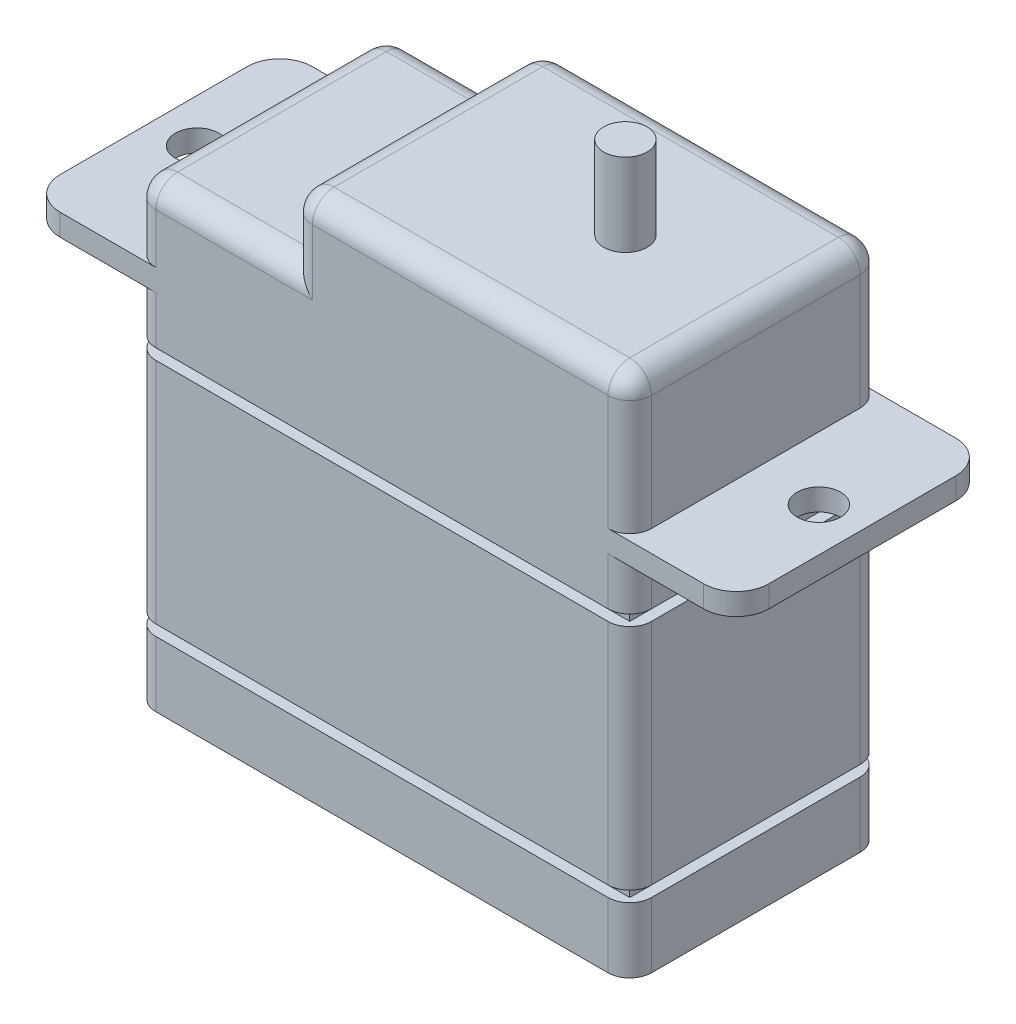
ISO-10303-21;
HEADER;
FILE_DESCRIPTION(('STEP AP214'),'2;1');
FILE_NAME('part.step','',(''),(''),'','','');
FILE_SCHEMA(('AUTOMOTIVE_DESIGN { 1 0 10303 214 1 1 1 1 }'));
ENDSEC;
DATA;
#1=APPLICATION_CONTEXT('core data for automotive mechanical design processes');
#2=APPLICATION_PROTOCOL_DEFINITION('international standard','automotive_design',2000,#1);
#3=PRODUCT_CONTEXT('',#1,'mechanical');
#4=PRODUCT('Part','Part','',(#3));
#5=PRODUCT_RELATED_PRODUCT_CATEGORY('part','',(#4));
#6=PRODUCT_DEFINITION_FORMATION('','',#4);
#7=PRODUCT_DEFINITION_CONTEXT('part definition',#1,'design');
#8=PRODUCT_DEFINITION('design','',#6,#7);
#9=PRODUCT_DEFINITION_SHAPE('','',#8);
#10=(LENGTH_UNIT() NAMED_UNIT(*) SI_UNIT(.MILLI.,.METRE.));
#11=(NAMED_UNIT(*) PLANE_ANGLE_UNIT() SI_UNIT($,.RADIAN.));
#12=(NAMED_UNIT(*) SI_UNIT($,.STERADIAN.) SOLID_ANGLE_UNIT());
#13=UNCERTAINTY_MEASURE_WITH_UNIT(LENGTH_MEASURE(1.E-05),#10,'distance_accuracy_value','');
#14=(GEOMETRIC_REPRESENTATION_CONTEXT(3) GLOBAL_UNCERTAINTY_ASSIGNED_CONTEXT((#13)) GLOBAL_UNIT_ASSIGNED_CONTEXT((#10,
#11,#12)) REPRESENTATION_CONTEXT('',''));
#15=CARTESIAN_POINT('',(0.,0.,0.));
#16=DIRECTION('',(0.,0.,1.));
#17=DIRECTION('',(1.,0.,0.));
#18=AXIS2_PLACEMENT_3D('',#15,#16,#17);
#19=CARTESIAN_POINT('',(7.2,24.,11.6));
#20=DIRECTION('',(0.,-1.,0.));
#21=DIRECTION('',(0.,0.,-1.));
#22=AXIS2_PLACEMENT_3D('',#19,#20,#21);
#23=PLANE('',#22);
#24=DIRECTION('',(-1.,0.,0.));
#25=VECTOR('',#24,1.);
#26=CARTESIAN_POINT('',(7.2,24.,10.6));
#27=LINE('',#26,#25);
#28=CARTESIAN_POINT('',(8.2,24.,10.6));
#29=VERTEX_POINT('',#28);
#30=CARTESIAN_POINT('',(21.8,24.,10.6));
#31=VERTEX_POINT('',#30);
#32=EDGE_CURVE('E574',#29,#31,#27,.F.);
#33=ORIENTED_EDGE('',*,*,#32,.T.);
#34=DIRECTION('',(0.,0.,-1.));
#35=VECTOR('',#34,1.);
#36=CARTESIAN_POINT('',(21.8,24.,11.6));
#37=LINE('',#36,#35);
#38=CARTESIAN_POINT('',(21.8,24.,1.));
#39=VERTEX_POINT('',#38);
#40=EDGE_CURVE('E578',#31,#39,#37,.T.);
#41=ORIENTED_EDGE('',*,*,#40,.T.);
#42=DIRECTION('',(-1.,0.,0.));
#43=VECTOR('',#42,1.);
#44=CARTESIAN_POINT('',(7.2,24.,1.));
#45=LINE('',#44,#43);
#46=CARTESIAN_POINT('',(8.2,24.,1.));
#47=VERTEX_POINT('',#46);
#48=EDGE_CURVE('E576',#39,#47,#45,.T.);
#49=ORIENTED_EDGE('',*,*,#48,.T.);
#50=DIRECTION('',(0.,0.,-1.));
#51=VECTOR('',#50,1.);
#52=CARTESIAN_POINT('',(8.2,24.,11.6));
#53=LINE('',#52,#51);
#54=EDGE_CURVE('E572',#47,#29,#53,.F.);
#55=ORIENTED_EDGE('',*,*,#54,.T.);
#56=EDGE_LOOP('',(#33,#41,#49,#55));
#57=FACE_BOUND('',#56,.T.);
#58=CARTESIAN_POINT('',(16.7999999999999,24.,5.8));
#59=DIRECTION('',(0.,-1.,0.));
#60=DIRECTION('',(0.,0.,-1.));
#61=AXIS2_PLACEMENT_3D('',#58,#59,#60);
#62=CIRCLE('',#61,1.);
#63=CARTESIAN_POINT('',(16.7999999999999,24.,4.8));
#64=VERTEX_POINT('',#63);
#65=EDGE_CURVE('E13',#64,#64,#62,.F.);
#66=ORIENTED_EDGE('',*,*,#65,.F.);
#67=EDGE_LOOP('',(#66));
#68=FACE_BOUND('',#67,.T.);
#69=ADVANCED_FACE('F37',(#57,#68),#23,.F.);
#70=CARTESIAN_POINT('',(22.8,0.,11.6));
#71=DIRECTION('',(-1.,0.,0.));
#72=DIRECTION('',(0.,0.,1.));
#73=AXIS2_PLACEMENT_3D('',#70,#71,#72);
#74=PLANE('',#73);
#75=DIRECTION('',(0.,0.,-1.));
#76=VECTOR('',#75,1.);
#77=CARTESIAN_POINT('',(22.8,16.7,0.));
#78=LINE('',#77,#76);
#79=CARTESIAN_POINT('',(22.8,16.7,10.6));
#80=VERTEX_POINT('',#79);
#81=CARTESIAN_POINT('',(22.8,16.7,1.));
#82=VERTEX_POINT('',#81);
#83=EDGE_CURVE('E408',#80,#82,#78,.T.);
#84=ORIENTED_EDGE('',*,*,#83,.F.);
#85=DIRECTION('',(0.,1.,0.));
#86=VECTOR('',#85,1.);
#87=CARTESIAN_POINT('',(22.8,0.,10.6));
#88=LINE('',#87,#86);
#89=CARTESIAN_POINT('',(22.8,14.5,10.6));
#90=VERTEX_POINT('',#89);
#91=EDGE_CURVE('E782',#80,#90,#88,.F.);
#92=ORIENTED_EDGE('',*,*,#91,.T.);
#93=DIRECTION('',(0.,0.,1.));
#94=VECTOR('',#93,1.);
#95=CARTESIAN_POINT('',(22.8,14.5,11.6));
#96=LINE('',#95,#94);
#97=CARTESIAN_POINT('',(22.8,14.5,1.));
#98=VERTEX_POINT('',#97);
#99=EDGE_CURVE('E664',#98,#90,#96,.T.);
#100=ORIENTED_EDGE('',*,*,#99,.F.);
#101=DIRECTION('',(0.,1.,0.));
#102=VECTOR('',#101,1.);
#103=CARTESIAN_POINT('',(22.8,16.7,1.));
#104=LINE('',#103,#102);
#105=EDGE_CURVE('E779',#98,#82,#104,.T.);
#106=ORIENTED_EDGE('',*,*,#105,.T.);
#107=EDGE_LOOP('',(#84,#92,#100,#106));
#108=FACE_BOUND('',#107,.T.);
#109=ADVANCED_FACE('F898',(#108),#74,.F.);
#110=CARTESIAN_POINT('',(0.,0.,11.6));
#111=DIRECTION('',(1.,0.,0.));
#112=DIRECTION('',(0.,0.,-1.));
#113=AXIS2_PLACEMENT_3D('',#110,#111,#112);
#114=PLANE('',#113);
#115=DIRECTION('',(0.,0.,-1.));
#116=VECTOR('',#115,1.);
#117=CARTESIAN_POINT('',(0.,14.5,11.6));
#118=LINE('',#117,#116);
#119=CARTESIAN_POINT('',(0.,14.5,10.6));
#120=VERTEX_POINT('',#119);
#121=CARTESIAN_POINT('',(0.,14.5,1.));
#122=VERTEX_POINT('',#121);
#123=EDGE_CURVE('E667',#120,#122,#118,.T.);
#124=ORIENTED_EDGE('',*,*,#123,.F.);
#125=DIRECTION('',(0.,-1.,0.));
#126=VECTOR('',#125,1.);
#127=CARTESIAN_POINT('',(0.,0.,10.6));
#128=LINE('',#127,#126);
#129=CARTESIAN_POINT('',(0.,16.7,10.6));
#130=VERTEX_POINT('',#129);
#131=EDGE_CURVE('E537',#120,#130,#128,.F.);
#132=ORIENTED_EDGE('',*,*,#131,.T.);
#133=DIRECTION('',(0.,0.,1.));
#134=VECTOR('',#133,1.);
#135=CARTESIAN_POINT('',(0.,16.7,11.6));
#136=LINE('',#135,#134);
#137=CARTESIAN_POINT('',(0.,16.7,1.));
#138=VERTEX_POINT('',#137);
#139=EDGE_CURVE('E522',#138,#130,#136,.T.);
#140=ORIENTED_EDGE('',*,*,#139,.F.);
#141=DIRECTION('',(0.,-1.,0.));
#142=VECTOR('',#141,1.);
#143=CARTESIAN_POINT('',(0.,14.5,1.));
#144=LINE('',#143,#142);
#145=EDGE_CURVE('E534',#138,#122,#144,.T.);
#146=ORIENTED_EDGE('',*,*,#145,.T.);
#147=EDGE_LOOP('',(#124,#132,#140,#146));
#148=FACE_BOUND('',#147,.T.);
#149=ADVANCED_FACE('F904',(#148),#114,.F.);
#150=DIRECTION('',(0.,0.,-1.));
#151=VECTOR('',#150,1.);
#152=CARTESIAN_POINT('',(0.,3.5,11.6));
#153=LINE('',#152,#151);
#154=CARTESIAN_POINT('',(0.,3.5,10.6));
#155=VERTEX_POINT('',#154);
#156=CARTESIAN_POINT('',(0.,3.5,1.));
#157=VERTEX_POINT('',#156);
#158=EDGE_CURVE('E717',#155,#157,#153,.T.);
#159=ORIENTED_EDGE('',*,*,#158,.F.);
#160=DIRECTION('',(0.,-1.,0.));
#161=VECTOR('',#160,1.);
#162=CARTESIAN_POINT('',(0.,0.,10.6));
#163=LINE('',#162,#161);
#164=CARTESIAN_POINT('',(0.,14.,10.6));
#165=VERTEX_POINT('',#164);
#166=EDGE_CURVE('E542',#155,#165,#163,.F.);
#167=ORIENTED_EDGE('',*,*,#166,.T.);
#168=DIRECTION('',(0.,0.,-1.));
#169=VECTOR('',#168,1.);
#170=CARTESIAN_POINT('',(0.,14.,11.6));
#171=LINE('',#170,#169);
#172=CARTESIAN_POINT('',(0.,14.,1.));
#173=VERTEX_POINT('',#172);
#174=EDGE_CURVE('E658',#165,#173,#171,.T.);
#175=ORIENTED_EDGE('',*,*,#174,.T.);
#176=DIRECTION('',(0.,-1.,0.));
#177=VECTOR('',#176,1.);
#178=CARTESIAN_POINT('',(0.,3.5,1.));
#179=LINE('',#178,#177);
#180=EDGE_CURVE('E539',#173,#157,#179,.T.);
#181=ORIENTED_EDGE('',*,*,#180,.T.);
#182=EDGE_LOOP('',(#159,#167,#175,#181));
#183=FACE_BOUND('',#182,.T.);
#184=ADVANCED_FACE('F1077',(#183),#114,.F.);
#185=DIRECTION('',(0.,0.,1.));
#186=VECTOR('',#185,1.);
#187=CARTESIAN_POINT('',(22.8,14.,11.6));
#188=LINE('',#187,#186);
#189=CARTESIAN_POINT('',(22.8,14.,1.));
#190=VERTEX_POINT('',#189);
#191=CARTESIAN_POINT('',(22.8,14.,10.6));
#192=VERTEX_POINT('',#191);
#193=EDGE_CURVE('E649',#190,#192,#188,.T.);
#194=ORIENTED_EDGE('',*,*,#193,.T.);
#195=DIRECTION('',(0.,1.,0.));
#196=VECTOR('',#195,1.);
#197=CARTESIAN_POINT('',(22.8,0.,10.6));
#198=LINE('',#197,#196);
#199=CARTESIAN_POINT('',(22.8,3.5,10.6));
#200=VERTEX_POINT('',#199);
#201=EDGE_CURVE('E463',#192,#200,#198,.F.);
#202=ORIENTED_EDGE('',*,*,#201,.T.);
#203=DIRECTION('',(0.,0.,1.));
#204=VECTOR('',#203,1.);
#205=CARTESIAN_POINT('',(22.8,3.5,11.6));
#206=LINE('',#205,#204);
#207=CARTESIAN_POINT('',(22.8,3.5,1.));
#208=VERTEX_POINT('',#207);
#209=EDGE_CURVE('E714',#208,#200,#206,.T.);
#210=ORIENTED_EDGE('',*,*,#209,.F.);
#211=DIRECTION('',(0.,1.,0.));
#212=VECTOR('',#211,1.);
#213=CARTESIAN_POINT('',(22.8,14.,1.));
#214=LINE('',#213,#212);
#215=EDGE_CURVE('E460',#208,#190,#214,.T.);
#216=ORIENTED_EDGE('',*,*,#215,.T.);
#217=EDGE_LOOP('',(#194,#202,#210,#216));
#218=FACE_BOUND('',#217,.T.);
#219=ADVANCED_FACE('F916',(#218),#74,.F.);
#220=CARTESIAN_POINT('',(0.,21.,11.6));
#221=DIRECTION('',(0.,0.,-1.));
#222=DIRECTION('',(-1.,0.,0.));
#223=AXIS2_PLACEMENT_3D('',#220,#221,#222);
#224=PLANE('',#223);
#225=DIRECTION('',(-1.,0.,0.));
#226=VECTOR('',#225,1.);
#227=CARTESIAN_POINT('',(0.,3.5,11.6));
#228=LINE('',#227,#226);
#229=CARTESIAN_POINT('',(21.8,3.5,11.6));
#230=VERTEX_POINT('',#229);
#231=CARTESIAN_POINT('',(1.,3.5,11.6));
#232=VERTEX_POINT('',#231);
#233=EDGE_CURVE('E720',#230,#232,#228,.T.);
#234=ORIENTED_EDGE('',*,*,#233,.F.);
#235=DIRECTION('',(0.,1.,0.));
#236=VECTOR('',#235,1.);
#237=CARTESIAN_POINT('',(21.8,21.,11.6));
#238=LINE('',#237,#236);
#239=CARTESIAN_POINT('',(21.8,14.,11.6));
#240=VERTEX_POINT('',#239);
#241=EDGE_CURVE('E449',#230,#240,#238,.T.);
#242=ORIENTED_EDGE('',*,*,#241,.T.);
#243=DIRECTION('',(-1.,0.,0.));
#244=VECTOR('',#243,1.);
#245=CARTESIAN_POINT('',(0.,14.,11.6));
#246=LINE('',#245,#244);
#247=CARTESIAN_POINT('',(1.,14.,11.6));
#248=VERTEX_POINT('',#247);
#249=EDGE_CURVE('E661',#240,#248,#246,.T.);
#250=ORIENTED_EDGE('',*,*,#249,.T.);
#251=DIRECTION('',(0.,-1.,0.));
#252=VECTOR('',#251,1.);
#253=CARTESIAN_POINT('',(1.,21.,11.6));
#254=LINE('',#253,#252);
#255=EDGE_CURVE('E446',#248,#232,#254,.T.);
#256=ORIENTED_EDGE('',*,*,#255,.T.);
#257=EDGE_LOOP('',(#234,#242,#250,#256));
#258=FACE_BOUND('',#257,.T.);
#259=ADVANCED_FACE('F928',(#258),#224,.F.);
#260=CARTESIAN_POINT('',(0.,21.,0.));
#261=DIRECTION('',(0.,0.,-1.));
#262=DIRECTION('',(-1.,0.,0.));
#263=AXIS2_PLACEMENT_3D('',#260,#261,#262);
#264=PLANE('',#263);
#265=DIRECTION('',(-1.,0.,0.));
#266=VECTOR('',#265,1.);
#267=CARTESIAN_POINT('',(0.,14.,0.));
#268=LINE('',#267,#266);
#269=CARTESIAN_POINT('',(21.8,14.,0.));
#270=VERTEX_POINT('',#269);
#271=CARTESIAN_POINT('',(1.,14.,0.));
#272=VERTEX_POINT('',#271);
#273=EDGE_CURVE('E744',#270,#272,#268,.T.);
#274=ORIENTED_EDGE('',*,*,#273,.F.);
#275=DIRECTION('',(0.,1.,0.));
#276=VECTOR('',#275,1.);
#277=CARTESIAN_POINT('',(21.8,3.5,0.));
#278=LINE('',#277,#276);
#279=CARTESIAN_POINT('',(21.8,3.5,0.));
#280=VERTEX_POINT('',#279);
#281=EDGE_CURVE('E566',#270,#280,#278,.F.);
#282=ORIENTED_EDGE('',*,*,#281,.T.);
#283=DIRECTION('',(-1.,0.,0.));
#284=VECTOR('',#283,1.);
#285=CARTESIAN_POINT('',(0.,3.5,0.));
#286=LINE('',#285,#284);
#287=CARTESIAN_POINT('',(1.,3.5,0.));
#288=VERTEX_POINT('',#287);
#289=EDGE_CURVE('E741',#280,#288,#286,.T.);
#290=ORIENTED_EDGE('',*,*,#289,.T.);
#291=DIRECTION('',(0.,-1.,0.));
#292=VECTOR('',#291,1.);
#293=CARTESIAN_POINT('',(1.,14.,0.));
#294=LINE('',#293,#292);
#295=EDGE_CURVE('E564',#288,#272,#294,.F.);
#296=ORIENTED_EDGE('',*,*,#295,.T.);
#297=EDGE_LOOP('',(#274,#282,#290,#296));
#298=FACE_BOUND('',#297,.T.);
#299=ADVANCED_FACE('F1087',(#298),#264,.T.);
#300=CARTESIAN_POINT('',(11.4,3.5,5.8));
#301=DIRECTION('',(0.,-1.,0.));
#302=DIRECTION('',(0.,0.,-1.));
#303=AXIS2_PLACEMENT_3D('',#300,#301,#302);
#304=PLANE('',#303);
#305=DIRECTION('',(-1.,0.,0.));
#306=VECTOR('',#305,1.);
#307=CARTESIAN_POINT('',(22.3,3.5,11.1));
#308=LINE('',#307,#306);
#309=CARTESIAN_POINT('',(22.3,3.5,11.1));
#310=VERTEX_POINT('',#309);
#311=CARTESIAN_POINT('',(0.5,3.5,11.1));
#312=VERTEX_POINT('',#311);
#313=EDGE_CURVE('E693',#310,#312,#308,.T.);
#314=ORIENTED_EDGE('',*,*,#313,.F.);
#315=DIRECTION('',(0.,0.,1.));
#316=VECTOR('',#315,1.);
#317=CARTESIAN_POINT('',(22.3,3.5,0.5));
#318=LINE('',#317,#316);
#319=CARTESIAN_POINT('',(22.3,3.5,0.5));
#320=VERTEX_POINT('',#319);
#321=EDGE_CURVE('E690',#320,#310,#318,.T.);
#322=ORIENTED_EDGE('',*,*,#321,.F.);
#323=DIRECTION('',(1.,0.,0.));
#324=VECTOR('',#323,1.);
#325=CARTESIAN_POINT('',(0.5,3.5,0.5));
#326=LINE('',#325,#324);
#327=CARTESIAN_POINT('',(0.5,3.5,0.5));
#328=VERTEX_POINT('',#327);
#329=EDGE_CURVE('E687',#328,#320,#326,.T.);
#330=ORIENTED_EDGE('',*,*,#329,.F.);
#331=DIRECTION('',(0.,0.,-1.));
#332=VECTOR('',#331,1.);
#333=CARTESIAN_POINT('',(0.5,3.5,11.1));
#334=LINE('',#333,#332);
#335=EDGE_CURVE('E684',#312,#328,#334,.T.);
#336=ORIENTED_EDGE('',*,*,#335,.F.);
#337=EDGE_LOOP('',(#314,#322,#330,#336));
#338=FACE_BOUND('',#337,.T.);
#339=ORIENTED_EDGE('',*,*,#209,.T.);
#340=CARTESIAN_POINT('',(21.8,3.5,10.6));
#341=DIRECTION('',(0.,-1.,0.));
#342=DIRECTION('',(0.,0.,-1.));
#343=AXIS2_PLACEMENT_3D('',#340,#341,#342);
#344=CIRCLE('',#343,1.);
#345=EDGE_CURVE('E471',#200,#230,#344,.T.);
#346=ORIENTED_EDGE('',*,*,#345,.T.);
#347=ORIENTED_EDGE('',*,*,#233,.T.);
#348=CARTESIAN_POINT('',(1.,3.5,10.6));
#349=DIRECTION('',(0.,-1.,0.));
#350=DIRECTION('',(0.,0.,-1.));
#351=AXIS2_PLACEMENT_3D('',#348,#349,#350);
#352=CIRCLE('',#351,1.);
#353=EDGE_CURVE('E469',#232,#155,#352,.T.);
#354=ORIENTED_EDGE('',*,*,#353,.T.);
#355=ORIENTED_EDGE('',*,*,#158,.T.);
#356=CARTESIAN_POINT('',(1.,3.5,1.));
#357=DIRECTION('',(0.,-1.,0.));
#358=DIRECTION('',(0.,0.,-1.));
#359=AXIS2_PLACEMENT_3D('',#356,#357,#358);
#360=CIRCLE('',#359,1.);
#361=EDGE_CURVE('E465',#157,#288,#360,.T.);
#362=ORIENTED_EDGE('',*,*,#361,.T.);
#363=ORIENTED_EDGE('',*,*,#289,.F.);
#364=CARTESIAN_POINT('',(21.8,3.5,1.));
#365=DIRECTION('',(0.,-1.,0.));
#366=DIRECTION('',(0.,0.,-1.));
#367=AXIS2_PLACEMENT_3D('',#364,#365,#366);
#368=CIRCLE('',#367,1.);
#369=EDGE_CURVE('E467',#280,#208,#368,.T.);
#370=ORIENTED_EDGE('',*,*,#369,.T.);
#371=EDGE_LOOP('',(#339,#346,#347,#354,#355,#362,#363,#370));
#372=FACE_BOUND('',#371,.T.);
#373=ADVANCED_FACE('F1068',(#338,#372),#304,.T.);
#374=CARTESIAN_POINT('',(11.4,3.,5.8));
#375=DIRECTION('',(0.,-1.,0.));
#376=DIRECTION('',(0.,0.,-1.));
#377=AXIS2_PLACEMENT_3D('',#374,#375,#376);
#378=PLANE('',#377);
#379=DIRECTION('',(0.,0.,-1.));
#380=VECTOR('',#379,1.);
#381=CARTESIAN_POINT('',(0.5,3.,11.1));
#382=LINE('',#381,#380);
#383=CARTESIAN_POINT('',(0.5,3.,11.1));
#384=VERTEX_POINT('',#383);
#385=CARTESIAN_POINT('',(0.5,3.,0.5));
#386=VERTEX_POINT('',#385);
#387=EDGE_CURVE('E673',#384,#386,#382,.T.);
#388=ORIENTED_EDGE('',*,*,#387,.T.);
#389=DIRECTION('',(1.,0.,0.));
#390=VECTOR('',#389,1.);
#391=CARTESIAN_POINT('',(0.5,3.,0.5));
#392=LINE('',#391,#390);
#393=CARTESIAN_POINT('',(22.3,3.,0.5));
#394=VERTEX_POINT('',#393);
#395=EDGE_CURVE('E675',#386,#394,#392,.T.);
#396=ORIENTED_EDGE('',*,*,#395,.T.);
#397=DIRECTION('',(0.,0.,1.));
#398=VECTOR('',#397,1.);
#399=CARTESIAN_POINT('',(22.3,3.,0.5));
#400=LINE('',#399,#398);
#401=CARTESIAN_POINT('',(22.3,3.,11.1));
#402=VERTEX_POINT('',#401);
#403=EDGE_CURVE('E678',#394,#402,#400,.T.);
#404=ORIENTED_EDGE('',*,*,#403,.T.);
#405=DIRECTION('',(-1.,0.,0.));
#406=VECTOR('',#405,1.);
#407=CARTESIAN_POINT('',(22.3,3.,11.1));
#408=LINE('',#407,#406);
#409=EDGE_CURVE('E681',#402,#384,#408,.T.);
#410=ORIENTED_EDGE('',*,*,#409,.T.);
#411=EDGE_LOOP('',(#388,#396,#404,#410));
#412=FACE_BOUND('',#411,.T.);
#413=DIRECTION('',(-1.,0.,0.));
#414=VECTOR('',#413,1.);
#415=CARTESIAN_POINT('',(0.,3.,11.6));
#416=LINE('',#415,#414);
#417=CARTESIAN_POINT('',(21.8,3.,11.6));
#418=VERTEX_POINT('',#417);
#419=CARTESIAN_POINT('',(1.,3.,11.6));
#420=VERTEX_POINT('',#419);
#421=EDGE_CURVE('E711',#418,#420,#416,.T.);
#422=ORIENTED_EDGE('',*,*,#421,.F.);
#423=CARTESIAN_POINT('',(21.8,3.,10.6));
#424=DIRECTION('',(0.,-1.,0.));
#425=DIRECTION('',(0.,0.,-1.));
#426=AXIS2_PLACEMENT_3D('',#423,#424,#425);
#427=CIRCLE('',#426,1.);
#428=CARTESIAN_POINT('',(22.8,3.,10.6));
#429=VERTEX_POINT('',#428);
#430=EDGE_CURVE('E431',#418,#429,#427,.F.);
#431=ORIENTED_EDGE('',*,*,#430,.T.);
#432=DIRECTION('',(0.,0.,1.));
#433=VECTOR('',#432,1.);
#434=CARTESIAN_POINT('',(22.8,3.,11.6));
#435=LINE('',#434,#433);
#436=CARTESIAN_POINT('',(22.8,3.,1.));
#437=VERTEX_POINT('',#436);
#438=EDGE_CURVE('E699',#437,#429,#435,.T.);
#439=ORIENTED_EDGE('',*,*,#438,.F.);
#440=CARTESIAN_POINT('',(21.8,3.,1.));
#441=DIRECTION('',(0.,-1.,0.));
#442=DIRECTION('',(0.,0.,-1.));
#443=AXIS2_PLACEMENT_3D('',#440,#441,#442);
#444=CIRCLE('',#443,1.);
#445=CARTESIAN_POINT('',(21.8,3.,0.));
#446=VERTEX_POINT('',#445);
#447=EDGE_CURVE('E427',#437,#446,#444,.F.);
#448=ORIENTED_EDGE('',*,*,#447,.T.);
#449=DIRECTION('',(-1.,0.,0.));
#450=VECTOR('',#449,1.);
#451=CARTESIAN_POINT('',(0.,3.,0.));
#452=LINE('',#451,#450);
#453=CARTESIAN_POINT('',(1.,3.,0.));
#454=VERTEX_POINT('',#453);
#455=EDGE_CURVE('E738',#446,#454,#452,.T.);
#456=ORIENTED_EDGE('',*,*,#455,.T.);
#457=CARTESIAN_POINT('',(1.,3.,1.));
#458=DIRECTION('',(0.,-1.,0.));
#459=DIRECTION('',(0.,0.,-1.));
#460=AXIS2_PLACEMENT_3D('',#457,#458,#459);
#461=CIRCLE('',#460,1.);
#462=CARTESIAN_POINT('',(0.,3.,1.));
#463=VERTEX_POINT('',#462);
#464=EDGE_CURVE('E425',#454,#463,#461,.F.);
#465=ORIENTED_EDGE('',*,*,#464,.T.);
#466=DIRECTION('',(0.,0.,-1.));
#467=VECTOR('',#466,1.);
#468=CARTESIAN_POINT('',(0.,3.,11.6));
#469=LINE('',#468,#467);
#470=CARTESIAN_POINT('',(0.,3.,10.6));
#471=VERTEX_POINT('',#470);
#472=EDGE_CURVE('E708',#471,#463,#469,.T.);
#473=ORIENTED_EDGE('',*,*,#472,.F.);
#474=CARTESIAN_POINT('',(1.,3.,10.6));
#475=DIRECTION('',(0.,-1.,0.));
#476=DIRECTION('',(0.,0.,-1.));
#477=AXIS2_PLACEMENT_3D('',#474,#475,#476);
#478=CIRCLE('',#477,1.);
#479=EDGE_CURVE('E429',#471,#420,#478,.F.);
#480=ORIENTED_EDGE('',*,*,#479,.T.);
#481=EDGE_LOOP('',(#422,#431,#439,#448,#456,#465,#473,#480));
#482=FACE_BOUND('',#481,.T.);
#483=ADVANCED_FACE('F942',(#412,#482),#378,.F.);
#484=CARTESIAN_POINT('',(0.5,3.5,11.1));
#485=DIRECTION('',(-1.,0.,0.));
#486=DIRECTION('',(0.,0.,1.));
#487=AXIS2_PLACEMENT_3D('',#484,#485,#486);
#488=PLANE('',#487);
#489=ORIENTED_EDGE('',*,*,#387,.F.);
#490=DIRECTION('',(0.,-1.,0.));
#491=VECTOR('',#490,1.);
#492=CARTESIAN_POINT('',(0.5,3.5,11.1));
#493=LINE('',#492,#491);
#494=EDGE_CURVE('E697',#312,#384,#493,.T.);
#495=ORIENTED_EDGE('',*,*,#494,.F.);
#496=ORIENTED_EDGE('',*,*,#335,.T.);
#497=DIRECTION('',(0.,-1.,0.));
#498=VECTOR('',#497,1.);
#499=CARTESIAN_POINT('',(0.5,3.5,0.5));
#500=LINE('',#499,#498);
#501=EDGE_CURVE('E696',#328,#386,#500,.T.);
#502=ORIENTED_EDGE('',*,*,#501,.T.);
#503=EDGE_LOOP('',(#489,#495,#496,#502));
#504=FACE_BOUND('',#503,.T.);
#505=ADVANCED_FACE('F1112',(#504),#488,.T.);
#506=CARTESIAN_POINT('',(22.3,3.5,11.1));
#507=DIRECTION('',(0.,0.,1.));
#508=DIRECTION('',(1.,0.,0.));
#509=AXIS2_PLACEMENT_3D('',#506,#507,#508);
#510=PLANE('',#509);
#511=ORIENTED_EDGE('',*,*,#409,.F.);
#512=DIRECTION('',(0.,-1.,0.));
#513=VECTOR('',#512,1.);
#514=CARTESIAN_POINT('',(22.3,3.5,11.1));
#515=LINE('',#514,#513);
#516=EDGE_CURVE('E700',#310,#402,#515,.T.);
#517=ORIENTED_EDGE('',*,*,#516,.F.);
#518=ORIENTED_EDGE('',*,*,#313,.T.);
#519=ORIENTED_EDGE('',*,*,#494,.T.);
#520=EDGE_LOOP('',(#511,#517,#518,#519));
#521=FACE_BOUND('',#520,.T.);
#522=ADVANCED_FACE('F1109',(#521),#510,.T.);
#523=CARTESIAN_POINT('',(22.3,3.5,0.5));
#524=DIRECTION('',(1.,0.,0.));
#525=DIRECTION('',(0.,0.,-1.));
#526=AXIS2_PLACEMENT_3D('',#523,#524,#525);
#527=PLANE('',#526);
#528=ORIENTED_EDGE('',*,*,#403,.F.);
#529=DIRECTION('',(0.,-1.,0.));
#530=VECTOR('',#529,1.);
#531=CARTESIAN_POINT('',(22.3,3.5,0.5));
#532=LINE('',#531,#530);
#533=EDGE_CURVE('E702',#320,#394,#532,.T.);
#534=ORIENTED_EDGE('',*,*,#533,.F.);
#535=ORIENTED_EDGE('',*,*,#321,.T.);
#536=ORIENTED_EDGE('',*,*,#516,.T.);
#537=EDGE_LOOP('',(#528,#534,#535,#536));
#538=FACE_BOUND('',#537,.T.);
#539=ADVANCED_FACE('F929',(#538),#527,.T.);
#540=CARTESIAN_POINT('',(0.5,3.5,0.5));
#541=DIRECTION('',(0.,0.,-1.));
#542=DIRECTION('',(-1.,0.,0.));
#543=AXIS2_PLACEMENT_3D('',#540,#541,#542);
#544=PLANE('',#543);
#545=ORIENTED_EDGE('',*,*,#395,.F.);
#546=ORIENTED_EDGE('',*,*,#501,.F.);
#547=ORIENTED_EDGE('',*,*,#329,.T.);
#548=ORIENTED_EDGE('',*,*,#533,.T.);
#549=EDGE_LOOP('',(#545,#546,#547,#548));
#550=FACE_BOUND('',#549,.T.);
#551=ADVANCED_FACE('F920',(#550),#544,.T.);
#552=CARTESIAN_POINT('',(0.,0.,11.6));
#553=DIRECTION('',(0.,1.,0.));
#554=DIRECTION('',(0.,0.,1.));
#555=AXIS2_PLACEMENT_3D('',#552,#553,#554);
#556=PLANE('',#555);
#557=DIRECTION('',(0.,0.,-1.));
#558=VECTOR('',#557,1.);
#559=CARTESIAN_POINT('',(22.8,0.,11.6));
#560=LINE('',#559,#558);
#561=CARTESIAN_POINT('',(22.8,0.,10.6));
#562=VERTEX_POINT('',#561);
#563=CARTESIAN_POINT('',(22.8,0.,1.));
#564=VERTEX_POINT('',#563);
#565=EDGE_CURVE('E732',#562,#564,#560,.T.);
#566=ORIENTED_EDGE('',*,*,#565,.F.);
#567=CARTESIAN_POINT('',(21.8,0.,10.6));
#568=DIRECTION('',(0.,1.,0.));
#569=DIRECTION('',(0.,0.,1.));
#570=AXIS2_PLACEMENT_3D('',#567,#568,#569);
#571=CIRCLE('',#570,1.);
#572=CARTESIAN_POINT('',(21.8,0.,11.6));
#573=VERTEX_POINT('',#572);
#574=EDGE_CURVE('E444',#562,#573,#571,.F.);
#575=ORIENTED_EDGE('',*,*,#574,.T.);
#576=DIRECTION('',(1.,0.,0.));
#577=VECTOR('',#576,1.);
#578=CARTESIAN_POINT('',(0.,0.,11.6));
#579=LINE('',#578,#577);
#580=CARTESIAN_POINT('',(1.,0.,11.6));
#581=VERTEX_POINT('',#580);
#582=EDGE_CURVE('E726',#581,#573,#579,.T.);
#583=ORIENTED_EDGE('',*,*,#582,.F.);
#584=CARTESIAN_POINT('',(1.,0.,10.6));
#585=DIRECTION('',(0.,1.,0.));
#586=DIRECTION('',(0.,0.,1.));
#587=AXIS2_PLACEMENT_3D('',#584,#585,#586);
#588=CIRCLE('',#587,1.);
#589=CARTESIAN_POINT('',(0.,0.,10.6));
#590=VERTEX_POINT('',#589);
#591=EDGE_CURVE('E442',#581,#590,#588,.F.);
#592=ORIENTED_EDGE('',*,*,#591,.T.);
#593=DIRECTION('',(0.,0.,-1.));
#594=VECTOR('',#593,1.);
#595=CARTESIAN_POINT('',(0.,0.,11.6));
#596=LINE('',#595,#594);
#597=CARTESIAN_POINT('',(0.,0.,1.));
#598=VERTEX_POINT('',#597);
#599=EDGE_CURVE('E735',#590,#598,#596,.T.);
#600=ORIENTED_EDGE('',*,*,#599,.T.);
#601=CARTESIAN_POINT('',(1.,0.,1.));
#602=DIRECTION('',(0.,1.,0.));
#603=DIRECTION('',(0.,0.,1.));
#604=AXIS2_PLACEMENT_3D('',#601,#602,#603);
#605=CIRCLE('',#604,1.);
#606=CARTESIAN_POINT('',(1.,0.,0.));
#607=VERTEX_POINT('',#606);
#608=EDGE_CURVE('E438',#598,#607,#605,.F.);
#609=ORIENTED_EDGE('',*,*,#608,.T.);
#610=DIRECTION('',(1.,0.,0.));
#611=VECTOR('',#610,1.);
#612=CARTESIAN_POINT('',(0.,0.,0.));
#613=LINE('',#612,#611);
#614=CARTESIAN_POINT('',(21.8,0.,0.));
#615=VERTEX_POINT('',#614);
#616=EDGE_CURVE('E723',#607,#615,#613,.T.);
#617=ORIENTED_EDGE('',*,*,#616,.T.);
#618=CARTESIAN_POINT('',(21.8,0.,1.));
#619=DIRECTION('',(0.,1.,0.));
#620=DIRECTION('',(0.,0.,1.));
#621=AXIS2_PLACEMENT_3D('',#618,#619,#620);
#622=CIRCLE('',#621,1.);
#623=EDGE_CURVE('E440',#615,#564,#622,.F.);
#624=ORIENTED_EDGE('',*,*,#623,.T.);
#625=EDGE_LOOP('',(#566,#575,#583,#592,#600,#609,#617,#624));
#626=FACE_BOUND('',#625,.T.);
#627=ADVANCED_FACE('F917',(#626),#556,.F.);
#628=ORIENTED_EDGE('',*,*,#582,.T.);
#629=DIRECTION('',(0.,1.,0.));
#630=VECTOR('',#629,1.);
#631=CARTESIAN_POINT('',(21.8,21.,11.6));
#632=LINE('',#631,#630);
#633=EDGE_CURVE('E421',#573,#418,#632,.T.);
#634=ORIENTED_EDGE('',*,*,#633,.T.);
#635=ORIENTED_EDGE('',*,*,#421,.T.);
#636=DIRECTION('',(0.,-1.,0.));
#637=VECTOR('',#636,1.);
#638=CARTESIAN_POINT('',(1.,21.,11.6));
#639=LINE('',#638,#637);
#640=EDGE_CURVE('E418',#420,#581,#639,.T.);
#641=ORIENTED_EDGE('',*,*,#640,.T.);
#642=EDGE_LOOP('',(#628,#634,#635,#641));
#643=FACE_BOUND('',#642,.T.);
#644=ADVANCED_FACE('F919',(#643),#224,.F.);
#645=ORIENTED_EDGE('',*,*,#455,.F.);
#646=DIRECTION('',(0.,1.,0.));
#647=VECTOR('',#646,1.);
#648=CARTESIAN_POINT('',(21.8,0.,0.));
#649=LINE('',#648,#647);
#650=EDGE_CURVE('E570',#446,#615,#649,.F.);
#651=ORIENTED_EDGE('',*,*,#650,.T.);
#652=ORIENTED_EDGE('',*,*,#616,.F.);
#653=DIRECTION('',(0.,-1.,0.));
#654=VECTOR('',#653,1.);
#655=CARTESIAN_POINT('',(1.,3.,0.));
#656=LINE('',#655,#654);
#657=EDGE_CURVE('E568',#607,#454,#656,.F.);
#658=ORIENTED_EDGE('',*,*,#657,.T.);
#659=EDGE_LOOP('',(#645,#651,#652,#658));
#660=FACE_BOUND('',#659,.T.);
#661=ADVANCED_FACE('F914',(#660),#264,.T.);
#662=ORIENTED_EDGE('',*,*,#438,.T.);
#663=DIRECTION('',(0.,1.,0.));
#664=VECTOR('',#663,1.);
#665=CARTESIAN_POINT('',(22.8,0.,10.6));
#666=LINE('',#665,#664);
#667=EDGE_CURVE('E436',#429,#562,#666,.F.);
#668=ORIENTED_EDGE('',*,*,#667,.T.);
#669=ORIENTED_EDGE('',*,*,#565,.T.);
#670=DIRECTION('',(0.,1.,0.));
#671=VECTOR('',#670,1.);
#672=CARTESIAN_POINT('',(22.8,3.,1.));
#673=LINE('',#672,#671);
#674=EDGE_CURVE('E433',#564,#437,#673,.T.);
#675=ORIENTED_EDGE('',*,*,#674,.T.);
#676=EDGE_LOOP('',(#662,#668,#669,#675));
#677=FACE_BOUND('',#676,.T.);
#678=ADVANCED_FACE('F908',(#677),#74,.F.);
#679=ORIENTED_EDGE('',*,*,#599,.F.);
#680=DIRECTION('',(0.,-1.,0.));
#681=VECTOR('',#680,1.);
#682=CARTESIAN_POINT('',(0.,0.,10.6));
#683=LINE('',#682,#681);
#684=EDGE_CURVE('E547',#590,#471,#683,.F.);
#685=ORIENTED_EDGE('',*,*,#684,.T.);
#686=ORIENTED_EDGE('',*,*,#472,.T.);
#687=DIRECTION('',(0.,-1.,0.));
#688=VECTOR('',#687,1.);
#689=CARTESIAN_POINT('',(0.,0.,1.));
#690=LINE('',#689,#688);
#691=EDGE_CURVE('E544',#463,#598,#690,.T.);
#692=ORIENTED_EDGE('',*,*,#691,.T.);
#693=EDGE_LOOP('',(#679,#685,#686,#692));
#694=FACE_BOUND('',#693,.T.);
#695=ADVANCED_FACE('F39',(#694),#114,.F.);
#696=CARTESIAN_POINT('',(11.4,14.5,5.8));
#697=DIRECTION('',(0.,-1.,0.));
#698=DIRECTION('',(0.,0.,-1.));
#699=AXIS2_PLACEMENT_3D('',#696,#697,#698);
#700=PLANE('',#699);
#701=DIRECTION('',(-1.,0.,0.));
#702=VECTOR('',#701,1.);
#703=CARTESIAN_POINT('',(22.3,14.5,11.1));
#704=LINE('',#703,#702);
#705=CARTESIAN_POINT('',(22.3,14.5,11.1));
#706=VERTEX_POINT('',#705);
#707=CARTESIAN_POINT('',(0.5,14.5,11.1));
#708=VERTEX_POINT('',#707);
#709=EDGE_CURVE('E643',#706,#708,#704,.T.);
#710=ORIENTED_EDGE('',*,*,#709,.F.);
#711=DIRECTION('',(0.,0.,1.));
#712=VECTOR('',#711,1.);
#713=CARTESIAN_POINT('',(22.3,14.5,0.5));
#714=LINE('',#713,#712);
#715=CARTESIAN_POINT('',(22.3,14.5,0.5));
#716=VERTEX_POINT('',#715);
#717=EDGE_CURVE('E640',#716,#706,#714,.T.);
#718=ORIENTED_EDGE('',*,*,#717,.F.);
#719=DIRECTION('',(1.,0.,0.));
#720=VECTOR('',#719,1.);
#721=CARTESIAN_POINT('',(0.5,14.5,0.5));
#722=LINE('',#721,#720);
#723=CARTESIAN_POINT('',(0.5,14.5,0.5));
#724=VERTEX_POINT('',#723);
#725=EDGE_CURVE('E637',#724,#716,#722,.T.);
#726=ORIENTED_EDGE('',*,*,#725,.F.);
#727=DIRECTION('',(0.,0.,-1.));
#728=VECTOR('',#727,1.);
#729=CARTESIAN_POINT('',(0.5,14.5,11.1));
#730=LINE('',#729,#728);
#731=EDGE_CURVE('E634',#708,#724,#730,.T.);
#732=ORIENTED_EDGE('',*,*,#731,.F.);
#733=EDGE_LOOP('',(#710,#718,#726,#732));
#734=FACE_BOUND('',#733,.T.);
#735=ORIENTED_EDGE('',*,*,#99,.T.);
#736=CARTESIAN_POINT('',(21.8,14.5,10.6));
#737=DIRECTION('',(0.,-1.,0.));
#738=DIRECTION('',(0.,0.,-1.));
#739=AXIS2_PLACEMENT_3D('',#736,#737,#738);
#740=CIRCLE('',#739,1.);
#741=CARTESIAN_POINT('',(21.8,14.5,11.6));
#742=VERTEX_POINT('',#741);
#743=EDGE_CURVE('E532',#90,#742,#740,.T.);
#744=ORIENTED_EDGE('',*,*,#743,.T.);
#745=DIRECTION('',(-1.,0.,0.));
#746=VECTOR('',#745,1.);
#747=CARTESIAN_POINT('',(0.,14.5,11.6));
#748=LINE('',#747,#746);
#749=CARTESIAN_POINT('',(1.,14.5,11.6));
#750=VERTEX_POINT('',#749);
#751=EDGE_CURVE('E670',#742,#750,#748,.T.);
#752=ORIENTED_EDGE('',*,*,#751,.T.);
#753=CARTESIAN_POINT('',(1.,14.5,10.6));
#754=DIRECTION('',(0.,-1.,0.));
#755=DIRECTION('',(0.,0.,-1.));
#756=AXIS2_PLACEMENT_3D('',#753,#754,#755);
#757=CIRCLE('',#756,1.);
#758=EDGE_CURVE('E787',#750,#120,#757,.T.);
#759=ORIENTED_EDGE('',*,*,#758,.T.);
#760=ORIENTED_EDGE('',*,*,#123,.T.);
#761=CARTESIAN_POINT('',(1.,14.5,1.));
#762=DIRECTION('',(0.,-1.,0.));
#763=DIRECTION('',(0.,0.,-1.));
#764=AXIS2_PLACEMENT_3D('',#761,#762,#763);
#765=CIRCLE('',#764,1.);
#766=CARTESIAN_POINT('',(1.,14.5,0.));
#767=VERTEX_POINT('',#766);
#768=EDGE_CURVE('E784',#122,#767,#765,.T.);
#769=ORIENTED_EDGE('',*,*,#768,.T.);
#770=DIRECTION('',(-1.,0.,0.));
#771=VECTOR('',#770,1.);
#772=CARTESIAN_POINT('',(0.,14.5,0.));
#773=LINE('',#772,#771);
#774=CARTESIAN_POINT('',(21.8,14.5,0.));
#775=VERTEX_POINT('',#774);
#776=EDGE_CURVE('E422',#775,#767,#773,.T.);
#777=ORIENTED_EDGE('',*,*,#776,.F.);
#778=CARTESIAN_POINT('',(21.8,14.5,1.));
#779=DIRECTION('',(0.,-1.,0.));
#780=DIRECTION('',(0.,0.,-1.));
#781=AXIS2_PLACEMENT_3D('',#778,#779,#780);
#782=CIRCLE('',#781,1.);
#783=EDGE_CURVE('E786',#775,#98,#782,.T.);
#784=ORIENTED_EDGE('',*,*,#783,.T.);
#785=EDGE_LOOP('',(#735,#744,#752,#759,#760,#769,#777,#784));
#786=FACE_BOUND('',#785,.T.);
#787=ADVANCED_FACE('F792',(#734,#786),#700,.T.);
#788=CARTESIAN_POINT('',(11.4,14.,5.8));
#789=DIRECTION('',(0.,-1.,0.));
#790=DIRECTION('',(0.,0.,-1.));
#791=AXIS2_PLACEMENT_3D('',#788,#789,#790);
#792=PLANE('',#791);
#793=DIRECTION('',(0.,0.,-1.));
#794=VECTOR('',#793,1.);
#795=CARTESIAN_POINT('',(0.5,14.,11.1));
#796=LINE('',#795,#794);
#797=CARTESIAN_POINT('',(0.5,14.,11.1));
#798=VERTEX_POINT('',#797);
#799=CARTESIAN_POINT('',(0.5,14.,0.5));
#800=VERTEX_POINT('',#799);
#801=EDGE_CURVE('E617',#798,#800,#796,.T.);
#802=ORIENTED_EDGE('',*,*,#801,.T.);
#803=DIRECTION('',(1.,0.,0.));
#804=VECTOR('',#803,1.);
#805=CARTESIAN_POINT('',(0.5,14.,0.5));
#806=LINE('',#805,#804);
#807=CARTESIAN_POINT('',(22.3,14.,0.5));
#808=VERTEX_POINT('',#807);
#809=EDGE_CURVE('E625',#800,#808,#806,.T.);
#810=ORIENTED_EDGE('',*,*,#809,.T.);
#811=DIRECTION('',(0.,0.,1.));
#812=VECTOR('',#811,1.);
#813=CARTESIAN_POINT('',(22.3,14.,0.5));
#814=LINE('',#813,#812);
#815=CARTESIAN_POINT('',(22.3,14.,11.1));
#816=VERTEX_POINT('',#815);
#817=EDGE_CURVE('E628',#808,#816,#814,.T.);
#818=ORIENTED_EDGE('',*,*,#817,.T.);
#819=DIRECTION('',(-1.,0.,0.));
#820=VECTOR('',#819,1.);
#821=CARTESIAN_POINT('',(22.3,14.,11.1));
#822=LINE('',#821,#820);
#823=EDGE_CURVE('E631',#816,#798,#822,.T.);
#824=ORIENTED_EDGE('',*,*,#823,.T.);
#825=EDGE_LOOP('',(#802,#810,#818,#824));
#826=FACE_BOUND('',#825,.T.);
#827=ORIENTED_EDGE('',*,*,#249,.F.);
#828=CARTESIAN_POINT('',(21.8,14.,10.6));
#829=DIRECTION('',(0.,-1.,0.));
#830=DIRECTION('',(0.,0.,-1.));
#831=AXIS2_PLACEMENT_3D('',#828,#829,#830);
#832=CIRCLE('',#831,1.);
#833=EDGE_CURVE('E458',#240,#192,#832,.F.);
#834=ORIENTED_EDGE('',*,*,#833,.T.);
#835=ORIENTED_EDGE('',*,*,#193,.F.);
#836=CARTESIAN_POINT('',(21.8,14.,1.));
#837=DIRECTION('',(0.,-1.,0.));
#838=DIRECTION('',(0.,0.,-1.));
#839=AXIS2_PLACEMENT_3D('',#836,#837,#838);
#840=CIRCLE('',#839,1.);
#841=EDGE_CURVE('E454',#190,#270,#840,.F.);
#842=ORIENTED_EDGE('',*,*,#841,.T.);
#843=ORIENTED_EDGE('',*,*,#273,.T.);
#844=CARTESIAN_POINT('',(1.,14.,1.));
#845=DIRECTION('',(0.,-1.,0.));
#846=DIRECTION('',(0.,0.,-1.));
#847=AXIS2_PLACEMENT_3D('',#844,#845,#846);
#848=CIRCLE('',#847,1.);
#849=EDGE_CURVE('E452',#272,#173,#848,.F.);
#850=ORIENTED_EDGE('',*,*,#849,.T.);
#851=ORIENTED_EDGE('',*,*,#174,.F.);
#852=CARTESIAN_POINT('',(1.,14.,10.6));
#853=DIRECTION('',(0.,-1.,0.));
#854=DIRECTION('',(0.,0.,-1.));
#855=AXIS2_PLACEMENT_3D('',#852,#853,#854);
#856=CIRCLE('',#855,1.);
#857=EDGE_CURVE('E456',#165,#248,#856,.F.);
#858=ORIENTED_EDGE('',*,*,#857,.T.);
#859=EDGE_LOOP('',(#827,#834,#835,#842,#843,#850,#851,#858));
#860=FACE_BOUND('',#859,.T.);
#861=ADVANCED_FACE('F1093',(#826,#860),#792,.F.);
#862=CARTESIAN_POINT('',(0.5,14.5,11.1));
#863=DIRECTION('',(-1.,0.,0.));
#864=DIRECTION('',(0.,0.,1.));
#865=AXIS2_PLACEMENT_3D('',#862,#863,#864);
#866=PLANE('',#865);
#867=ORIENTED_EDGE('',*,*,#801,.F.);
#868=DIRECTION('',(0.,-1.,0.));
#869=VECTOR('',#868,1.);
#870=CARTESIAN_POINT('',(0.5,14.5,11.1));
#871=LINE('',#870,#869);
#872=EDGE_CURVE('E647',#708,#798,#871,.T.);
#873=ORIENTED_EDGE('',*,*,#872,.F.);
#874=ORIENTED_EDGE('',*,*,#731,.T.);
#875=DIRECTION('',(0.,-1.,0.));
#876=VECTOR('',#875,1.);
#877=CARTESIAN_POINT('',(0.5,14.5,0.5));
#878=LINE('',#877,#876);
#879=EDGE_CURVE('E646',#724,#800,#878,.T.);
#880=ORIENTED_EDGE('',*,*,#879,.T.);
#881=EDGE_LOOP('',(#867,#873,#874,#880));
#882=FACE_BOUND('',#881,.T.);
#883=ADVANCED_FACE('F1095',(#882),#866,.T.);
#884=CARTESIAN_POINT('',(22.3,14.5,11.1));
#885=DIRECTION('',(0.,0.,1.));
#886=DIRECTION('',(1.,0.,0.));
#887=AXIS2_PLACEMENT_3D('',#884,#885,#886);
#888=PLANE('',#887);
#889=ORIENTED_EDGE('',*,*,#823,.F.);
#890=DIRECTION('',(0.,-1.,0.));
#891=VECTOR('',#890,1.);
#892=CARTESIAN_POINT('',(22.3,14.5,11.1));
#893=LINE('',#892,#891);
#894=EDGE_CURVE('E650',#706,#816,#893,.T.);
#895=ORIENTED_EDGE('',*,*,#894,.F.);
#896=ORIENTED_EDGE('',*,*,#709,.T.);
#897=ORIENTED_EDGE('',*,*,#872,.T.);
#898=EDGE_LOOP('',(#889,#895,#896,#897));
#899=FACE_BOUND('',#898,.T.);
#900=ADVANCED_FACE('F1102',(#899),#888,.T.);
#901=CARTESIAN_POINT('',(22.3,14.5,0.5));
#902=DIRECTION('',(1.,0.,0.));
#903=DIRECTION('',(0.,0.,-1.));
#904=AXIS2_PLACEMENT_3D('',#901,#902,#903);
#905=PLANE('',#904);
#906=ORIENTED_EDGE('',*,*,#817,.F.);
#907=DIRECTION('',(0.,-1.,0.));
#908=VECTOR('',#907,1.);
#909=CARTESIAN_POINT('',(22.3,14.5,0.5));
#910=LINE('',#909,#908);
#911=EDGE_CURVE('E652',#716,#808,#910,.T.);
#912=ORIENTED_EDGE('',*,*,#911,.F.);
#913=ORIENTED_EDGE('',*,*,#717,.T.);
#914=ORIENTED_EDGE('',*,*,#894,.T.);
#915=EDGE_LOOP('',(#906,#912,#913,#914));
#916=FACE_BOUND('',#915,.T.);
#917=ADVANCED_FACE('F1475',(#916),#905,.T.);
#918=CARTESIAN_POINT('',(0.5,14.5,0.5));
#919=DIRECTION('',(0.,0.,-1.));
#920=DIRECTION('',(-1.,0.,0.));
#921=AXIS2_PLACEMENT_3D('',#918,#919,#920);
#922=PLANE('',#921);
#923=ORIENTED_EDGE('',*,*,#809,.F.);
#924=ORIENTED_EDGE('',*,*,#879,.F.);
#925=ORIENTED_EDGE('',*,*,#725,.T.);
#926=ORIENTED_EDGE('',*,*,#911,.T.);
#927=EDGE_LOOP('',(#923,#924,#925,#926));
#928=FACE_BOUND('',#927,.T.);
#929=ADVANCED_FACE('F1134',(#928),#922,.T.);
#930=CARTESIAN_POINT('',(7.2,21.,11.6));
#931=DIRECTION('',(1.,0.,0.));
#932=DIRECTION('',(0.,0.,-1.));
#933=AXIS2_PLACEMENT_3D('',#930,#931,#932);
#934=PLANE('',#933);
#935=DIRECTION('',(0.,0.,-1.));
#936=VECTOR('',#935,1.);
#937=CARTESIAN_POINT('',(7.2,23.,11.6));
#938=LINE('',#937,#936);
#939=CARTESIAN_POINT('',(7.2,23.,10.6));
#940=VERTEX_POINT('',#939);
#941=CARTESIAN_POINT('',(7.2,23.,1.));
#942=VERTEX_POINT('',#941);
#943=EDGE_CURVE('E583',#940,#942,#938,.T.);
#944=ORIENTED_EDGE('',*,*,#943,.T.);
#945=DIRECTION('',(0.,-1.,0.));
#946=VECTOR('',#945,1.);
#947=CARTESIAN_POINT('',(7.2,21.,1.));
#948=LINE('',#947,#946);
#949=CARTESIAN_POINT('',(7.2,21.,1.));
#950=VERTEX_POINT('',#949);
#951=EDGE_CURVE('E586',#942,#950,#948,.T.);
#952=ORIENTED_EDGE('',*,*,#951,.T.);
#953=DIRECTION('',(0.,0.,-1.));
#954=VECTOR('',#953,1.);
#955=CARTESIAN_POINT('',(7.2,21.,11.6));
#956=LINE('',#955,#954);
#957=CARTESIAN_POINT('',(7.2,21.,10.6));
#958=VERTEX_POINT('',#957);
#959=EDGE_CURVE('E729',#958,#950,#956,.T.);
#960=ORIENTED_EDGE('',*,*,#959,.F.);
#961=DIRECTION('',(0.,-1.,0.));
#962=VECTOR('',#961,1.);
#963=CARTESIAN_POINT('',(7.2,21.,10.6));
#964=LINE('',#963,#962);
#965=EDGE_CURVE('E581',#958,#940,#964,.F.);
#966=ORIENTED_EDGE('',*,*,#965,.T.);
#967=EDGE_LOOP('',(#944,#952,#960,#966));
#968=FACE_BOUND('',#967,.T.);
#969=ADVANCED_FACE('F911',(#968),#934,.F.);
#970=CARTESIAN_POINT('',(0.,21.,11.6));
#971=DIRECTION('',(0.,-1.,0.));
#972=DIRECTION('',(0.,0.,-1.));
#973=AXIS2_PLACEMENT_3D('',#970,#971,#972);
#974=PLANE('',#973);
#975=DIRECTION('',(0.,0.,-1.));
#976=VECTOR('',#975,1.);
#977=CARTESIAN_POINT('',(1.,21.,11.6));
#978=LINE('',#977,#976);
#979=CARTESIAN_POINT('',(1.,21.,1.));
#980=VERTEX_POINT('',#979);
#981=CARTESIAN_POINT('',(1.,21.,10.6));
#982=VERTEX_POINT('',#981);
#983=EDGE_CURVE('E590',#980,#982,#978,.F.);
#984=ORIENTED_EDGE('',*,*,#983,.T.);
#985=DIRECTION('',(-1.,0.,0.));
#986=VECTOR('',#985,1.);
#987=CARTESIAN_POINT('',(0.,21.,10.6));
#988=LINE('',#987,#986);
#989=EDGE_CURVE('E592',#982,#958,#988,.F.);
#990=ORIENTED_EDGE('',*,*,#989,.T.);
#991=ORIENTED_EDGE('',*,*,#959,.T.);
#992=DIRECTION('',(-1.,0.,0.));
#993=VECTOR('',#992,1.);
#994=CARTESIAN_POINT('',(0.,21.,1.));
#995=LINE('',#994,#993);
#996=EDGE_CURVE('E588',#950,#980,#995,.T.);
#997=ORIENTED_EDGE('',*,*,#996,.T.);
#998=EDGE_LOOP('',(#984,#990,#991,#997));
#999=FACE_BOUND('',#998,.T.);
#1000=ADVANCED_FACE('F1127',(#999),#974,.F.);
#1001=ORIENTED_EDGE('',*,*,#751,.F.);
#1002=DIRECTION('',(0.,1.,0.));
#1003=VECTOR('',#1002,1.);
#1004=CARTESIAN_POINT('',(21.8,21.,11.6));
#1005=LINE('',#1004,#1003);
#1006=CARTESIAN_POINT('',(21.8,16.7,11.6));
#1007=VERTEX_POINT('',#1006);
#1008=EDGE_CURVE('E488',#742,#1007,#1005,.T.);
#1009=ORIENTED_EDGE('',*,*,#1008,.T.);
#1010=DIRECTION('',(-1.,0.,0.));
#1011=VECTOR('',#1010,1.);
#1012=CARTESIAN_POINT('',(22.8,16.7,11.6));
#1013=LINE('',#1012,#1011);
#1014=CARTESIAN_POINT('',(26.2,16.7,11.6));
#1015=VERTEX_POINT('',#1014);
#1016=EDGE_CURVE('E496',#1015,#1007,#1013,.T.);
#1017=ORIENTED_EDGE('',*,*,#1016,.F.);
#1018=DIRECTION('',(0.,-1.,0.));
#1019=VECTOR('',#1018,1.);
#1020=CARTESIAN_POINT('',(26.2,17.7,11.6));
#1021=LINE('',#1020,#1019);
#1022=CARTESIAN_POINT('',(26.2,17.7,11.6));
#1023=VERTEX_POINT('',#1022);
#1024=EDGE_CURVE('E511',#1023,#1015,#1021,.T.);
#1025=ORIENTED_EDGE('',*,*,#1024,.F.);
#1026=DIRECTION('',(-1.,0.,0.));
#1027=VECTOR('',#1026,1.);
#1028=CARTESIAN_POINT('',(22.8,17.7,11.6));
#1029=LINE('',#1028,#1027);
#1030=CARTESIAN_POINT('',(21.8,17.7,11.6));
#1031=VERTEX_POINT('',#1030);
#1032=EDGE_CURVE('E394',#1023,#1031,#1029,.T.);
#1033=ORIENTED_EDGE('',*,*,#1032,.T.);
#1034=DIRECTION('',(0.,1.,0.));
#1035=VECTOR('',#1034,1.);
#1036=CARTESIAN_POINT('',(21.8,21.,11.6));
#1037=LINE('',#1036,#1035);
#1038=CARTESIAN_POINT('',(21.8,23.,11.6));
#1039=VERTEX_POINT('',#1038);
#1040=EDGE_CURVE('E482',#1031,#1039,#1037,.T.);
#1041=ORIENTED_EDGE('',*,*,#1040,.T.);
#1042=DIRECTION('',(-1.,0.,0.));
#1043=VECTOR('',#1042,1.);
#1044=CARTESIAN_POINT('',(0.,23.,11.6));
#1045=LINE('',#1044,#1043);
#1046=CARTESIAN_POINT('',(8.2,23.,11.6));
#1047=VERTEX_POINT('',#1046);
#1048=EDGE_CURVE('E480',#1039,#1047,#1045,.T.);
#1049=ORIENTED_EDGE('',*,*,#1048,.T.);
#1050=DIRECTION('',(0.,-1.,0.));
#1051=VECTOR('',#1050,1.);
#1052=CARTESIAN_POINT('',(8.2,21.,11.6));
#1053=LINE('',#1052,#1051);
#1054=CARTESIAN_POINT('',(8.2,20.,11.6));
#1055=VERTEX_POINT('',#1054);
#1056=EDGE_CURVE('E478',#1047,#1055,#1053,.T.);
#1057=ORIENTED_EDGE('',*,*,#1056,.T.);
#1058=DIRECTION('',(-1.,0.,0.));
#1059=VECTOR('',#1058,1.);
#1060=CARTESIAN_POINT('',(0.,20.,11.6));
#1061=LINE('',#1060,#1059);
#1062=CARTESIAN_POINT('',(1.,20.,11.6));
#1063=VERTEX_POINT('',#1062);
#1064=EDGE_CURVE('E476',#1055,#1063,#1061,.T.);
#1065=ORIENTED_EDGE('',*,*,#1064,.T.);
#1066=DIRECTION('',(0.,-1.,0.));
#1067=VECTOR('',#1066,1.);
#1068=CARTESIAN_POINT('',(1.,21.,11.6));
#1069=LINE('',#1068,#1067);
#1070=CARTESIAN_POINT('',(1.,17.7,11.6));
#1071=VERTEX_POINT('',#1070);
#1072=EDGE_CURVE('E473',#1063,#1071,#1069,.T.);
#1073=ORIENTED_EDGE('',*,*,#1072,.T.);
#1074=DIRECTION('',(-1.,0.,0.));
#1075=VECTOR('',#1074,1.);
#1076=CARTESIAN_POINT('',(0.,17.7,11.6));
#1077=LINE('',#1076,#1075);
#1078=CARTESIAN_POINT('',(-3.4,17.7,11.6));
#1079=VERTEX_POINT('',#1078);
#1080=EDGE_CURVE('E598',#1071,#1079,#1077,.T.);
#1081=ORIENTED_EDGE('',*,*,#1080,.T.);
#1082=DIRECTION('',(0.,-1.,0.));
#1083=VECTOR('',#1082,1.);
#1084=CARTESIAN_POINT('',(-3.4,17.7,11.6));
#1085=LINE('',#1084,#1083);
#1086=CARTESIAN_POINT('',(-3.4,16.7,11.6));
#1087=VERTEX_POINT('',#1086);
#1088=EDGE_CURVE('E622',#1079,#1087,#1085,.T.);
#1089=ORIENTED_EDGE('',*,*,#1088,.T.);
#1090=DIRECTION('',(-1.,0.,0.));
#1091=VECTOR('',#1090,1.);
#1092=CARTESIAN_POINT('',(0.,16.7,11.6));
#1093=LINE('',#1092,#1091);
#1094=CARTESIAN_POINT('',(1.,16.7,11.6));
#1095=VERTEX_POINT('',#1094);
#1096=EDGE_CURVE('E531',#1095,#1087,#1093,.T.);
#1097=ORIENTED_EDGE('',*,*,#1096,.F.);
#1098=DIRECTION('',(0.,-1.,0.));
#1099=VECTOR('',#1098,1.);
#1100=CARTESIAN_POINT('',(1.,21.,11.6));
#1101=LINE('',#1100,#1099);
#1102=EDGE_CURVE('E485',#1095,#750,#1101,.T.);
#1103=ORIENTED_EDGE('',*,*,#1102,.T.);
#1104=EDGE_LOOP('',(#1001,#1009,#1017,#1025,#1033,#1041,#1049,#1057,#1065,#1073,#1081,#1089,
#1097,#1103));
#1105=FACE_BOUND('',#1104,.T.);
#1106=ADVANCED_FACE('F798',(#1105),#224,.F.);
#1107=DIRECTION('',(1.,0.,0.));
#1108=VECTOR('',#1107,1.);
#1109=CARTESIAN_POINT('',(22.8,16.7,0.));
#1110=LINE('',#1109,#1108);
#1111=CARTESIAN_POINT('',(21.8,16.7,0.));
#1112=VERTEX_POINT('',#1111);
#1113=CARTESIAN_POINT('',(26.2,16.7,0.));
#1114=VERTEX_POINT('',#1113);
#1115=EDGE_CURVE('E386',#1112,#1114,#1110,.T.);
#1116=ORIENTED_EDGE('',*,*,#1115,.F.);
#1117=DIRECTION('',(0.,1.,0.));
#1118=VECTOR('',#1117,1.);
#1119=CARTESIAN_POINT('',(21.8,14.5,0.));
#1120=LINE('',#1119,#1118);
#1121=EDGE_CURVE('E562',#1112,#775,#1120,.F.);
#1122=ORIENTED_EDGE('',*,*,#1121,.T.);
#1123=ORIENTED_EDGE('',*,*,#776,.T.);
#1124=DIRECTION('',(0.,-1.,0.));
#1125=VECTOR('',#1124,1.);
#1126=CARTESIAN_POINT('',(1.,16.7,0.));
#1127=LINE('',#1126,#1125);
#1128=CARTESIAN_POINT('',(1.,16.7,0.));
#1129=VERTEX_POINT('',#1128);
#1130=EDGE_CURVE('E559',#767,#1129,#1127,.F.);
#1131=ORIENTED_EDGE('',*,*,#1130,.T.);
#1132=DIRECTION('',(1.,0.,0.));
#1133=VECTOR('',#1132,1.);
#1134=CARTESIAN_POINT('',(0.,16.7,0.));
#1135=LINE('',#1134,#1133);
#1136=CARTESIAN_POINT('',(-3.4,16.7,0.));
#1137=VERTEX_POINT('',#1136);
#1138=EDGE_CURVE('E599',#1137,#1129,#1135,.T.);
#1139=ORIENTED_EDGE('',*,*,#1138,.F.);
#1140=DIRECTION('',(0.,-1.,0.));
#1141=VECTOR('',#1140,1.);
#1142=CARTESIAN_POINT('',(-3.4,17.7,0.));
#1143=LINE('',#1142,#1141);
#1144=CARTESIAN_POINT('',(-3.4,17.7,0.));
#1145=VERTEX_POINT('',#1144);
#1146=EDGE_CURVE('E615',#1145,#1137,#1143,.T.);
#1147=ORIENTED_EDGE('',*,*,#1146,.F.);
#1148=DIRECTION('',(1.,0.,0.));
#1149=VECTOR('',#1148,1.);
#1150=CARTESIAN_POINT('',(0.,17.7,0.));
#1151=LINE('',#1150,#1149);
#1152=CARTESIAN_POINT('',(1.,17.7,0.));
#1153=VERTEX_POINT('',#1152);
#1154=EDGE_CURVE('E614',#1145,#1153,#1151,.T.);
#1155=ORIENTED_EDGE('',*,*,#1154,.T.);
#1156=DIRECTION('',(0.,-1.,0.));
#1157=VECTOR('',#1156,1.);
#1158=CARTESIAN_POINT('',(1.,21.,0.));
#1159=LINE('',#1158,#1157);
#1160=CARTESIAN_POINT('',(1.,20.,0.));
#1161=VERTEX_POINT('',#1160);
#1162=EDGE_CURVE('E551',#1153,#1161,#1159,.F.);
#1163=ORIENTED_EDGE('',*,*,#1162,.T.);
#1164=DIRECTION('',(-1.,0.,0.));
#1165=VECTOR('',#1164,1.);
#1166=CARTESIAN_POINT('',(7.2,20.,0.));
#1167=LINE('',#1166,#1165);
#1168=CARTESIAN_POINT('',(8.2,20.,0.));
#1169=VERTEX_POINT('',#1168);
#1170=EDGE_CURVE('E549',#1161,#1169,#1167,.F.);
#1171=ORIENTED_EDGE('',*,*,#1170,.T.);
#1172=DIRECTION('',(0.,-1.,0.));
#1173=VECTOR('',#1172,1.);
#1174=CARTESIAN_POINT('',(8.2,24.,0.));
#1175=LINE('',#1174,#1173);
#1176=CARTESIAN_POINT('',(8.2,23.,0.));
#1177=VERTEX_POINT('',#1176);
#1178=EDGE_CURVE('E553',#1169,#1177,#1175,.F.);
#1179=ORIENTED_EDGE('',*,*,#1178,.T.);
#1180=DIRECTION('',(-1.,0.,0.));
#1181=VECTOR('',#1180,1.);
#1182=CARTESIAN_POINT('',(22.8,23.,0.));
#1183=LINE('',#1182,#1181);
#1184=CARTESIAN_POINT('',(21.8,23.,0.));
#1185=VERTEX_POINT('',#1184);
#1186=EDGE_CURVE('E555',#1177,#1185,#1183,.F.);
#1187=ORIENTED_EDGE('',*,*,#1186,.T.);
#1188=DIRECTION('',(0.,1.,0.));
#1189=VECTOR('',#1188,1.);
#1190=CARTESIAN_POINT('',(21.8,17.7,0.));
#1191=LINE('',#1190,#1189);
#1192=CARTESIAN_POINT('',(21.8,17.7,0.));
#1193=VERTEX_POINT('',#1192);
#1194=EDGE_CURVE('E557',#1185,#1193,#1191,.F.);
#1195=ORIENTED_EDGE('',*,*,#1194,.T.);
#1196=DIRECTION('',(1.,0.,0.));
#1197=VECTOR('',#1196,1.);
#1198=CARTESIAN_POINT('',(22.8,17.7,0.));
#1199=LINE('',#1198,#1197);
#1200=CARTESIAN_POINT('',(26.2,17.7,0.));
#1201=VERTEX_POINT('',#1200);
#1202=EDGE_CURVE('E389',#1193,#1201,#1199,.T.);
#1203=ORIENTED_EDGE('',*,*,#1202,.T.);
#1204=DIRECTION('',(0.,-1.,0.));
#1205=VECTOR('',#1204,1.);
#1206=CARTESIAN_POINT('',(26.2,17.7,0.));
#1207=LINE('',#1206,#1205);
#1208=EDGE_CURVE('E382',#1201,#1114,#1207,.T.);
#1209=ORIENTED_EDGE('',*,*,#1208,.T.);
#1210=EDGE_LOOP('',(#1116,#1122,#1123,#1131,#1139,#1147,#1155,#1163,#1171,#1179,#1187,#1195,
#1203,#1209));
#1211=FACE_BOUND('',#1210,.T.);
#1212=ADVANCED_FACE('F384',(#1211),#264,.T.);
#1213=DIRECTION('',(0.,0.,-1.));
#1214=VECTOR('',#1213,1.);
#1215=CARTESIAN_POINT('',(22.8,23.,11.6));
#1216=LINE('',#1215,#1214);
#1217=CARTESIAN_POINT('',(22.8,23.,1.));
#1218=VERTEX_POINT('',#1217);
#1219=CARTESIAN_POINT('',(22.8,23.,10.6));
#1220=VERTEX_POINT('',#1219);
#1221=EDGE_CURVE('E491',#1218,#1220,#1216,.F.);
#1222=ORIENTED_EDGE('',*,*,#1221,.T.);
#1223=DIRECTION('',(0.,1.,0.));
#1224=VECTOR('',#1223,1.);
#1225=CARTESIAN_POINT('',(22.8,0.,10.6));
#1226=LINE('',#1225,#1224);
#1227=CARTESIAN_POINT('',(22.8,17.7,10.6));
#1228=VERTEX_POINT('',#1227);
#1229=EDGE_CURVE('E778',#1220,#1228,#1226,.F.);
#1230=ORIENTED_EDGE('',*,*,#1229,.T.);
#1231=DIRECTION('',(0.,0.,-1.));
#1232=VECTOR('',#1231,1.);
#1233=CARTESIAN_POINT('',(22.8,17.7,0.));
#1234=LINE('',#1233,#1232);
#1235=CARTESIAN_POINT('',(22.8,17.7,1.));
#1236=VERTEX_POINT('',#1235);
#1237=EDGE_CURVE('E492',#1228,#1236,#1234,.T.);
#1238=ORIENTED_EDGE('',*,*,#1237,.T.);
#1239=DIRECTION('',(0.,1.,0.));
#1240=VECTOR('',#1239,1.);
#1241=CARTESIAN_POINT('',(22.8,24.,1.));
#1242=LINE('',#1241,#1240);
#1243=EDGE_CURVE('E1597',#1236,#1218,#1242,.T.);
#1244=ORIENTED_EDGE('',*,*,#1243,.T.);
#1245=EDGE_LOOP('',(#1222,#1230,#1238,#1244));
#1246=FACE_BOUND('',#1245,.T.);
#1247=ADVANCED_FACE('F907',(#1246),#74,.F.);
#1248=DIRECTION('',(0.,0.,1.));
#1249=VECTOR('',#1248,1.);
#1250=CARTESIAN_POINT('',(0.,17.7,11.6));
#1251=LINE('',#1250,#1249);
#1252=CARTESIAN_POINT('',(0.,17.7,1.));
#1253=VERTEX_POINT('',#1252);
#1254=CARTESIAN_POINT('',(0.,17.7,10.6));
#1255=VERTEX_POINT('',#1254);
#1256=EDGE_CURVE('E595',#1253,#1255,#1251,.T.);
#1257=ORIENTED_EDGE('',*,*,#1256,.T.);
#1258=DIRECTION('',(0.,-1.,0.));
#1259=VECTOR('',#1258,1.);
#1260=CARTESIAN_POINT('',(0.,0.,10.6));
#1261=LINE('',#1260,#1259);
#1262=CARTESIAN_POINT('',(0.,20.,10.6));
#1263=VERTEX_POINT('',#1262);
#1264=EDGE_CURVE('E52',#1255,#1263,#1261,.F.);
#1265=ORIENTED_EDGE('',*,*,#1264,.T.);
#1266=DIRECTION('',(0.,0.,-1.));
#1267=VECTOR('',#1266,1.);
#1268=CARTESIAN_POINT('',(0.,20.,11.6));
#1269=LINE('',#1268,#1267);
#1270=CARTESIAN_POINT('',(0.,20.,1.));
#1271=VERTEX_POINT('',#1270);
#1272=EDGE_CURVE('E56',#1263,#1271,#1269,.T.);
#1273=ORIENTED_EDGE('',*,*,#1272,.T.);
#1274=DIRECTION('',(0.,-1.,0.));
#1275=VECTOR('',#1274,1.);
#1276=CARTESIAN_POINT('',(0.,17.7,1.));
#1277=LINE('',#1276,#1275);
#1278=EDGE_CURVE('E594',#1271,#1253,#1277,.T.);
#1279=ORIENTED_EDGE('',*,*,#1278,.T.);
#1280=EDGE_LOOP('',(#1257,#1265,#1273,#1279));
#1281=FACE_BOUND('',#1280,.T.);
#1282=ADVANCED_FACE('F857',(#1281),#114,.F.);
#1283=CARTESIAN_POINT('',(-3.4,17.7,1.5));
#1284=DIRECTION('',(0.,-1.,0.));
#1285=DIRECTION('',(0.,0.,-1.));
#1286=AXIS2_PLACEMENT_3D('',#1283,#1284,#1285);
#1287=CYLINDRICAL_SURFACE('',#1286,1.5);
#1288=CARTESIAN_POINT('',(-3.4,16.7,1.5));
#1289=DIRECTION('',(0.,-1.,0.));
#1290=DIRECTION('',(0.,0.,1.));
#1291=AXIS2_PLACEMENT_3D('',#1288,#1289,#1290);
#1292=CIRCLE('',#1291,1.5);
#1293=CARTESIAN_POINT('',(-4.9,16.7,1.5));
#1294=VERTEX_POINT('',#1293);
#1295=EDGE_CURVE('E604',#1294,#1137,#1292,.T.);
#1296=ORIENTED_EDGE('',*,*,#1295,.F.);
#1297=DIRECTION('',(0.,-1.,0.));
#1298=VECTOR('',#1297,1.);
#1299=CARTESIAN_POINT('',(-4.9,17.7,1.5));
#1300=LINE('',#1299,#1298);
#1301=CARTESIAN_POINT('',(-4.9,17.7,1.5));
#1302=VERTEX_POINT('',#1301);
#1303=EDGE_CURVE('E618',#1302,#1294,#1300,.T.);
#1304=ORIENTED_EDGE('',*,*,#1303,.F.);
#1305=CARTESIAN_POINT('',(-3.4,17.7,1.5));
#1306=DIRECTION('',(0.,-1.,0.));
#1307=DIRECTION('',(0.,0.,1.));
#1308=AXIS2_PLACEMENT_3D('',#1305,#1306,#1307);
#1309=CIRCLE('',#1308,1.5);
#1310=EDGE_CURVE('E611',#1302,#1145,#1309,.T.);
#1311=ORIENTED_EDGE('',*,*,#1310,.T.);
#1312=ORIENTED_EDGE('',*,*,#1146,.T.);
#1313=EDGE_LOOP('',(#1296,#1304,#1311,#1312));
#1314=FACE_BOUND('',#1313,.T.);
#1315=ADVANCED_FACE('F838',(#1314),#1287,.T.);
#1316=CARTESIAN_POINT('',(-4.9,17.7,10.1));
#1317=DIRECTION('',(-1.,0.,0.));
#1318=DIRECTION('',(0.,0.,1.));
#1319=AXIS2_PLACEMENT_3D('',#1316,#1317,#1318);
#1320=PLANE('',#1319);
#1321=DIRECTION('',(0.,0.,-1.));
#1322=VECTOR('',#1321,1.);
#1323=CARTESIAN_POINT('',(-4.9,16.7,10.1));
#1324=LINE('',#1323,#1322);
#1325=CARTESIAN_POINT('',(-4.9,16.7,10.1));
#1326=VERTEX_POINT('',#1325);
#1327=EDGE_CURVE('E845',#1326,#1294,#1324,.T.);
#1328=ORIENTED_EDGE('',*,*,#1327,.F.);
#1329=DIRECTION('',(0.,-1.,0.));
#1330=VECTOR('',#1329,1.);
#1331=CARTESIAN_POINT('',(-4.9,17.7,10.1));
#1332=LINE('',#1331,#1330);
#1333=CARTESIAN_POINT('',(-4.9,17.7,10.1));
#1334=VERTEX_POINT('',#1333);
#1335=EDGE_CURVE('E620',#1334,#1326,#1332,.T.);
#1336=ORIENTED_EDGE('',*,*,#1335,.F.);
#1337=DIRECTION('',(0.,0.,-1.));
#1338=VECTOR('',#1337,1.);
#1339=CARTESIAN_POINT('',(-4.9,17.7,10.1));
#1340=LINE('',#1339,#1338);
#1341=EDGE_CURVE('E608',#1334,#1302,#1340,.T.);
#1342=ORIENTED_EDGE('',*,*,#1341,.T.);
#1343=ORIENTED_EDGE('',*,*,#1303,.T.);
#1344=EDGE_LOOP('',(#1328,#1336,#1342,#1343));
#1345=FACE_BOUND('',#1344,.T.);
#1346=ADVANCED_FACE('F843',(#1345),#1320,.T.);
#1347=CARTESIAN_POINT('',(-3.4,17.7,10.1));
#1348=DIRECTION('',(0.,-1.,0.));
#1349=DIRECTION('',(0.,0.,-1.));
#1350=AXIS2_PLACEMENT_3D('',#1347,#1348,#1349);
#1351=CYLINDRICAL_SURFACE('',#1350,1.5);
#1352=CARTESIAN_POINT('',(-3.4,16.7,10.1));
#1353=DIRECTION('',(0.,-1.,0.));
#1354=DIRECTION('',(0.,0.,-1.));
#1355=AXIS2_PLACEMENT_3D('',#1352,#1353,#1354);
#1356=CIRCLE('',#1355,1.5);
#1357=EDGE_CURVE('E525',#1087,#1326,#1356,.T.);
#1358=ORIENTED_EDGE('',*,*,#1357,.F.);
#1359=ORIENTED_EDGE('',*,*,#1088,.F.);
#1360=CARTESIAN_POINT('',(-3.4,17.7,10.1));
#1361=DIRECTION('',(0.,-1.,0.));
#1362=DIRECTION('',(0.,0.,-1.));
#1363=AXIS2_PLACEMENT_3D('',#1360,#1361,#1362);
#1364=CIRCLE('',#1363,1.5);
#1365=EDGE_CURVE('E605',#1079,#1334,#1364,.T.);
#1366=ORIENTED_EDGE('',*,*,#1365,.T.);
#1367=ORIENTED_EDGE('',*,*,#1335,.T.);
#1368=EDGE_LOOP('',(#1358,#1359,#1366,#1367));
#1369=FACE_BOUND('',#1368,.T.);
#1370=ADVANCED_FACE('F849',(#1369),#1351,.T.);
#1371=CARTESIAN_POINT('',(-3.4,17.7,1.5));
#1372=DIRECTION('',(0.,1.,0.));
#1373=DIRECTION('',(0.,0.,1.));
#1374=AXIS2_PLACEMENT_3D('',#1371,#1372,#1373);
#1375=PLANE('',#1374);
#1376=CARTESIAN_POINT('',(-2.9,17.7,5.80000000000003));
#1377=DIRECTION('',(0.,-1.,0.));
#1378=DIRECTION('',(0.,0.,-1.));
#1379=AXIS2_PLACEMENT_3D('',#1376,#1377,#1378);
#1380=CIRCLE('',#1379,1.);
#1381=CARTESIAN_POINT('',(-2.9,17.7,4.80000000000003));
#1382=VERTEX_POINT('',#1381);
#1383=EDGE_CURVE('E519',#1382,#1382,#1380,.T.);
#1384=ORIENTED_EDGE('',*,*,#1383,.T.);
#1385=EDGE_LOOP('',(#1384));
#1386=FACE_BOUND('',#1385,.T.);
#1387=ORIENTED_EDGE('',*,*,#1256,.F.);
#1388=CARTESIAN_POINT('',(1.,17.7,1.));
#1389=DIRECTION('',(0.,1.,0.));
#1390=DIRECTION('',(0.,0.,1.));
#1391=AXIS2_PLACEMENT_3D('',#1388,#1389,#1390);
#1392=CIRCLE('',#1391,1.);
#1393=EDGE_CURVE('E45',#1253,#1153,#1392,.F.);
#1394=ORIENTED_EDGE('',*,*,#1393,.T.);
#1395=ORIENTED_EDGE('',*,*,#1154,.F.);
#1396=ORIENTED_EDGE('',*,*,#1310,.F.);
#1397=ORIENTED_EDGE('',*,*,#1341,.F.);
#1398=ORIENTED_EDGE('',*,*,#1365,.F.);
#1399=ORIENTED_EDGE('',*,*,#1080,.F.);
#1400=CARTESIAN_POINT('',(1.,17.7,10.6));
#1401=DIRECTION('',(0.,1.,0.));
#1402=DIRECTION('',(0.,0.,1.));
#1403=AXIS2_PLACEMENT_3D('',#1400,#1401,#1402);
#1404=CIRCLE('',#1403,1.);
#1405=EDGE_CURVE('E817',#1071,#1255,#1404,.F.);
#1406=ORIENTED_EDGE('',*,*,#1405,.T.);
#1407=EDGE_LOOP('',(#1387,#1394,#1395,#1396,#1397,#1398,#1399,#1406));
#1408=FACE_BOUND('',#1407,.T.);
#1409=ADVANCED_FACE('F824',(#1386,#1408),#1375,.T.);
#1410=CARTESIAN_POINT('',(-3.4,16.7,1.5));
#1411=DIRECTION('',(0.,1.,0.));
#1412=DIRECTION('',(0.,0.,1.));
#1413=AXIS2_PLACEMENT_3D('',#1410,#1411,#1412);
#1414=PLANE('',#1413);
#1415=CARTESIAN_POINT('',(-2.9,16.7,5.80000000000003));
#1416=DIRECTION('',(0.,-1.,0.));
#1417=DIRECTION('',(0.,0.,-1.));
#1418=AXIS2_PLACEMENT_3D('',#1415,#1416,#1417);
#1419=CIRCLE('',#1418,1.);
#1420=CARTESIAN_POINT('',(-2.9,16.7,4.80000000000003));
#1421=VERTEX_POINT('',#1420);
#1422=EDGE_CURVE('E513',#1421,#1421,#1419,.T.);
#1423=ORIENTED_EDGE('',*,*,#1422,.F.);
#1424=EDGE_LOOP('',(#1423));
#1425=FACE_BOUND('',#1424,.T.);
#1426=ORIENTED_EDGE('',*,*,#1138,.T.);
#1427=CARTESIAN_POINT('',(1.,16.7,1.));
#1428=DIRECTION('',(0.,1.,0.));
#1429=DIRECTION('',(0.,0.,1.));
#1430=AXIS2_PLACEMENT_3D('',#1427,#1428,#1429);
#1431=CIRCLE('',#1430,1.);
#1432=EDGE_CURVE('E815',#1129,#138,#1431,.T.);
#1433=ORIENTED_EDGE('',*,*,#1432,.T.);
#1434=ORIENTED_EDGE('',*,*,#139,.T.);
#1435=CARTESIAN_POINT('',(1.,16.7,10.6));
#1436=DIRECTION('',(0.,1.,0.));
#1437=DIRECTION('',(0.,0.,1.));
#1438=AXIS2_PLACEMENT_3D('',#1435,#1436,#1437);
#1439=CIRCLE('',#1438,1.);
#1440=EDGE_CURVE('E803',#130,#1095,#1439,.T.);
#1441=ORIENTED_EDGE('',*,*,#1440,.T.);
#1442=ORIENTED_EDGE('',*,*,#1096,.T.);
#1443=ORIENTED_EDGE('',*,*,#1357,.T.);
#1444=ORIENTED_EDGE('',*,*,#1327,.T.);
#1445=ORIENTED_EDGE('',*,*,#1295,.T.);
#1446=EDGE_LOOP('',(#1426,#1433,#1434,#1441,#1442,#1443,#1444,#1445));
#1447=FACE_BOUND('',#1446,.T.);
#1448=ADVANCED_FACE('F1401',(#1425,#1447),#1414,.F.);
#1449=CARTESIAN_POINT('',(-2.9,17.7,5.80000000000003));
#1450=DIRECTION('',(0.,-1.,0.));
#1451=DIRECTION('',(0.,0.,-1.));
#1452=AXIS2_PLACEMENT_3D('',#1449,#1450,#1451);
#1453=CYLINDRICAL_SURFACE('',#1452,1.);
#1454=ORIENTED_EDGE('',*,*,#1383,.F.);
#1455=EDGE_LOOP('',(#1454));
#1456=FACE_BOUND('',#1455,.T.);
#1457=ORIENTED_EDGE('',*,*,#1422,.T.);
#1458=EDGE_LOOP('',(#1457));
#1459=FACE_BOUND('',#1458,.T.);
#1460=ADVANCED_FACE('F1393',(#1456,#1459),#1453,.F.);
#1461=CARTESIAN_POINT('',(26.2,17.7,10.1));
#1462=DIRECTION('',(0.,-1.,0.));
#1463=DIRECTION('',(0.,0.,-1.));
#1464=AXIS2_PLACEMENT_3D('',#1461,#1462,#1463);
#1465=CYLINDRICAL_SURFACE('',#1464,1.5);
#1466=CARTESIAN_POINT('',(26.2,16.7,10.1));
#1467=DIRECTION('',(0.,-1.,0.));
#1468=DIRECTION('',(0.,0.,1.));
#1469=AXIS2_PLACEMENT_3D('',#1466,#1467,#1468);
#1470=CIRCLE('',#1469,1.5);
#1471=CARTESIAN_POINT('',(27.7,16.7,10.1));
#1472=VERTEX_POINT('',#1471);
#1473=EDGE_CURVE('E501',#1472,#1015,#1470,.T.);
#1474=ORIENTED_EDGE('',*,*,#1473,.F.);
#1475=DIRECTION('',(0.,-1.,0.));
#1476=VECTOR('',#1475,1.);
#1477=CARTESIAN_POINT('',(27.7,17.7,10.1));
#1478=LINE('',#1477,#1476);
#1479=CARTESIAN_POINT('',(27.7,17.7,10.1));
#1480=VERTEX_POINT('',#1479);
#1481=EDGE_CURVE('E514',#1480,#1472,#1478,.T.);
#1482=ORIENTED_EDGE('',*,*,#1481,.F.);
#1483=CARTESIAN_POINT('',(26.2,17.7,10.1));
#1484=DIRECTION('',(0.,-1.,0.));
#1485=DIRECTION('',(0.,0.,1.));
#1486=AXIS2_PLACEMENT_3D('',#1483,#1484,#1485);
#1487=CIRCLE('',#1486,1.5);
#1488=EDGE_CURVE('E508',#1480,#1023,#1487,.T.);
#1489=ORIENTED_EDGE('',*,*,#1488,.T.);
#1490=ORIENTED_EDGE('',*,*,#1024,.T.);
#1491=EDGE_LOOP('',(#1474,#1482,#1489,#1490));
#1492=FACE_BOUND('',#1491,.T.);
#1493=ADVANCED_FACE('F1385',(#1492),#1465,.T.);
#1494=CARTESIAN_POINT('',(27.7,17.7,1.5));
#1495=DIRECTION('',(1.,0.,0.));
#1496=DIRECTION('',(0.,0.,-1.));
#1497=AXIS2_PLACEMENT_3D('',#1494,#1495,#1496);
#1498=PLANE('',#1497);
#1499=DIRECTION('',(0.,0.,1.));
#1500=VECTOR('',#1499,1.);
#1501=CARTESIAN_POINT('',(27.7,16.7,1.5));
#1502=LINE('',#1501,#1500);
#1503=CARTESIAN_POINT('',(27.7,16.7,1.5));
#1504=VERTEX_POINT('',#1503);
#1505=EDGE_CURVE('E402',#1504,#1472,#1502,.T.);
#1506=ORIENTED_EDGE('',*,*,#1505,.F.);
#1507=DIRECTION('',(0.,-1.,0.));
#1508=VECTOR('',#1507,1.);
#1509=CARTESIAN_POINT('',(27.7,17.7,1.5));
#1510=LINE('',#1509,#1508);
#1511=CARTESIAN_POINT('',(27.7,17.7,1.5));
#1512=VERTEX_POINT('',#1511);
#1513=EDGE_CURVE('E393',#1512,#1504,#1510,.T.);
#1514=ORIENTED_EDGE('',*,*,#1513,.F.);
#1515=DIRECTION('',(0.,0.,1.));
#1516=VECTOR('',#1515,1.);
#1517=CARTESIAN_POINT('',(27.7,17.7,1.5));
#1518=LINE('',#1517,#1516);
#1519=EDGE_CURVE('E505',#1512,#1480,#1518,.T.);
#1520=ORIENTED_EDGE('',*,*,#1519,.T.);
#1521=ORIENTED_EDGE('',*,*,#1481,.T.);
#1522=EDGE_LOOP('',(#1506,#1514,#1520,#1521));
#1523=FACE_BOUND('',#1522,.T.);
#1524=ADVANCED_FACE('F1378',(#1523),#1498,.T.);
#1525=CARTESIAN_POINT('',(26.2,17.7,1.5));
#1526=DIRECTION('',(0.,-1.,0.));
#1527=DIRECTION('',(0.,0.,-1.));
#1528=AXIS2_PLACEMENT_3D('',#1525,#1526,#1527);
#1529=CYLINDRICAL_SURFACE('',#1528,1.5);
#1530=CARTESIAN_POINT('',(26.2,16.7,1.5));
#1531=DIRECTION('',(0.,-1.,0.));
#1532=DIRECTION('',(0.,0.,-1.));
#1533=AXIS2_PLACEMENT_3D('',#1530,#1531,#1532);
#1534=CIRCLE('',#1533,1.5);
#1535=EDGE_CURVE('E397',#1114,#1504,#1534,.T.);
#1536=ORIENTED_EDGE('',*,*,#1535,.F.);
#1537=ORIENTED_EDGE('',*,*,#1208,.F.);
#1538=CARTESIAN_POINT('',(26.2,17.7,1.5));
#1539=DIRECTION('',(0.,-1.,0.));
#1540=DIRECTION('',(0.,0.,-1.));
#1541=AXIS2_PLACEMENT_3D('',#1538,#1539,#1540);
#1542=CIRCLE('',#1541,1.5);
#1543=EDGE_CURVE('E503',#1201,#1512,#1542,.T.);
#1544=ORIENTED_EDGE('',*,*,#1543,.T.);
#1545=ORIENTED_EDGE('',*,*,#1513,.T.);
#1546=EDGE_LOOP('',(#1536,#1537,#1544,#1545));
#1547=FACE_BOUND('',#1546,.T.);
#1548=ADVANCED_FACE('F398',(#1547),#1529,.T.);
#1549=CARTESIAN_POINT('',(26.2,17.7,10.1));
#1550=DIRECTION('',(0.,1.,0.));
#1551=DIRECTION('',(0.,0.,1.));
#1552=AXIS2_PLACEMENT_3D('',#1549,#1550,#1551);
#1553=PLANE('',#1552);
#1554=CARTESIAN_POINT('',(25.7,17.7,5.80000000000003));
#1555=DIRECTION('',(0.,-1.,0.));
#1556=DIRECTION('',(0.,0.,-1.));
#1557=AXIS2_PLACEMENT_3D('',#1554,#1555,#1556);
#1558=CIRCLE('',#1557,0.999999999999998);
#1559=CARTESIAN_POINT('',(25.7,17.7,4.80000000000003));
#1560=VERTEX_POINT('',#1559);
#1561=EDGE_CURVE('E410',#1560,#1560,#1558,.T.);
#1562=ORIENTED_EDGE('',*,*,#1561,.T.);
#1563=EDGE_LOOP('',(#1562));
#1564=FACE_BOUND('',#1563,.T.);
#1565=ORIENTED_EDGE('',*,*,#1237,.F.);
#1566=CARTESIAN_POINT('',(21.8,17.7,10.6));
#1567=DIRECTION('',(0.,1.,0.));
#1568=DIRECTION('',(0.,0.,1.));
#1569=AXIS2_PLACEMENT_3D('',#1566,#1567,#1568);
#1570=CIRCLE('',#1569,1.);
#1571=EDGE_CURVE('E804',#1228,#1031,#1570,.F.);
#1572=ORIENTED_EDGE('',*,*,#1571,.T.);
#1573=ORIENTED_EDGE('',*,*,#1032,.F.);
#1574=ORIENTED_EDGE('',*,*,#1488,.F.);
#1575=ORIENTED_EDGE('',*,*,#1519,.F.);
#1576=ORIENTED_EDGE('',*,*,#1543,.F.);
#1577=ORIENTED_EDGE('',*,*,#1202,.F.);
#1578=CARTESIAN_POINT('',(21.8,17.7,1.));
#1579=DIRECTION('',(0.,1.,0.));
#1580=DIRECTION('',(0.,0.,1.));
#1581=AXIS2_PLACEMENT_3D('',#1578,#1579,#1580);
#1582=CIRCLE('',#1581,1.);
#1583=EDGE_CURVE('E807',#1193,#1236,#1582,.F.);
#1584=ORIENTED_EDGE('',*,*,#1583,.T.);
#1585=EDGE_LOOP('',(#1565,#1572,#1573,#1574,#1575,#1576,#1577,#1584));
#1586=FACE_BOUND('',#1585,.T.);
#1587=ADVANCED_FACE('F881',(#1564,#1586),#1553,.T.);
#1588=CARTESIAN_POINT('',(26.2,16.7,10.1));
#1589=DIRECTION('',(0.,1.,0.));
#1590=DIRECTION('',(0.,0.,1.));
#1591=AXIS2_PLACEMENT_3D('',#1588,#1589,#1590);
#1592=PLANE('',#1591);
#1593=CARTESIAN_POINT('',(25.7,16.7,5.80000000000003));
#1594=DIRECTION('',(0.,-1.,0.));
#1595=DIRECTION('',(0.,0.,-1.));
#1596=AXIS2_PLACEMENT_3D('',#1593,#1594,#1595);
#1597=CIRCLE('',#1596,0.999999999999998);
#1598=CARTESIAN_POINT('',(25.7,16.7,4.80000000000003));
#1599=VERTEX_POINT('',#1598);
#1600=EDGE_CURVE('E866',#1599,#1599,#1597,.T.);
#1601=ORIENTED_EDGE('',*,*,#1600,.F.);
#1602=EDGE_LOOP('',(#1601));
#1603=FACE_BOUND('',#1602,.T.);
#1604=ORIENTED_EDGE('',*,*,#1016,.T.);
#1605=CARTESIAN_POINT('',(21.8,16.7,10.6));
#1606=DIRECTION('',(0.,1.,0.));
#1607=DIRECTION('',(0.,0.,1.));
#1608=AXIS2_PLACEMENT_3D('',#1605,#1606,#1607);
#1609=CIRCLE('',#1608,1.);
#1610=EDGE_CURVE('E801',#1007,#80,#1609,.T.);
#1611=ORIENTED_EDGE('',*,*,#1610,.T.);
#1612=ORIENTED_EDGE('',*,*,#83,.T.);
#1613=CARTESIAN_POINT('',(21.8,16.7,1.));
#1614=DIRECTION('',(0.,1.,0.));
#1615=DIRECTION('',(0.,0.,1.));
#1616=AXIS2_PLACEMENT_3D('',#1613,#1614,#1615);
#1617=CIRCLE('',#1616,1.);
#1618=EDGE_CURVE('E406',#82,#1112,#1617,.T.);
#1619=ORIENTED_EDGE('',*,*,#1618,.T.);
#1620=ORIENTED_EDGE('',*,*,#1115,.T.);
#1621=ORIENTED_EDGE('',*,*,#1535,.T.);
#1622=ORIENTED_EDGE('',*,*,#1505,.T.);
#1623=ORIENTED_EDGE('',*,*,#1473,.T.);
#1624=EDGE_LOOP('',(#1604,#1611,#1612,#1619,#1620,#1621,#1622,#1623));
#1625=FACE_BOUND('',#1624,.T.);
#1626=ADVANCED_FACE('F404',(#1603,#1625),#1592,.F.);
#1627=CARTESIAN_POINT('',(25.7,17.7,5.80000000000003));
#1628=DIRECTION('',(0.,-1.,0.));
#1629=DIRECTION('',(0.,0.,-1.));
#1630=AXIS2_PLACEMENT_3D('',#1627,#1628,#1629);
#1631=CYLINDRICAL_SURFACE('',#1630,0.999999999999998);
#1632=ORIENTED_EDGE('',*,*,#1561,.F.);
#1633=EDGE_LOOP('',(#1632));
#1634=FACE_BOUND('',#1633,.T.);
#1635=ORIENTED_EDGE('',*,*,#1600,.T.);
#1636=EDGE_LOOP('',(#1635));
#1637=FACE_BOUND('',#1636,.T.);
#1638=ADVANCED_FACE('F884',(#1634,#1637),#1631,.F.);
#1639=CARTESIAN_POINT('',(21.8,21.,10.6));
#1640=DIRECTION('',(0.,1.,0.));
#1641=DIRECTION('',(0.,0.,1.));
#1642=AXIS2_PLACEMENT_3D('',#1639,#1640,#1641);
#1643=CYLINDRICAL_SURFACE('',#1642,1.);
#1644=ORIENTED_EDGE('',*,*,#574,.F.);
#1645=ORIENTED_EDGE('',*,*,#667,.F.);
#1646=ORIENTED_EDGE('',*,*,#430,.F.);
#1647=ORIENTED_EDGE('',*,*,#633,.F.);
#1648=EDGE_LOOP('',(#1644,#1645,#1646,#1647));
#1649=FACE_BOUND('',#1648,.T.);
#1650=ADVANCED_FACE('F886',(#1649),#1643,.T.);
#1651=CARTESIAN_POINT('',(21.8,21.,10.6));
#1652=DIRECTION('',(0.,1.,0.));
#1653=DIRECTION('',(0.,0.,1.));
#1654=AXIS2_PLACEMENT_3D('',#1651,#1652,#1653);
#1655=CYLINDRICAL_SURFACE('',#1654,1.);
#1656=ORIENTED_EDGE('',*,*,#345,.F.);
#1657=ORIENTED_EDGE('',*,*,#201,.F.);
#1658=ORIENTED_EDGE('',*,*,#833,.F.);
#1659=ORIENTED_EDGE('',*,*,#241,.F.);
#1660=EDGE_LOOP('',(#1656,#1657,#1658,#1659));
#1661=FACE_BOUND('',#1660,.T.);
#1662=ADVANCED_FACE('F892',(#1661),#1655,.T.);
#1663=CARTESIAN_POINT('',(1.,0.,1.));
#1664=DIRECTION('',(0.,1.,0.));
#1665=DIRECTION('',(0.,0.,1.));
#1666=AXIS2_PLACEMENT_3D('',#1663,#1664,#1665);
#1667=CYLINDRICAL_SURFACE('',#1666,1.);
#1668=CARTESIAN_POINT('',(1.,20.,1.));
#1669=DIRECTION('',(0.,1.,0.));
#1670=DIRECTION('',(0.,0.,1.));
#1671=AXIS2_PLACEMENT_3D('',#1668,#1669,#1670);
#1672=CIRCLE('',#1671,1.);
#1673=EDGE_CURVE('E830',#1161,#1271,#1672,.T.);
#1674=ORIENTED_EDGE('',*,*,#1673,.F.);
#1675=ORIENTED_EDGE('',*,*,#1162,.F.);
#1676=ORIENTED_EDGE('',*,*,#1393,.F.);
#1677=ORIENTED_EDGE('',*,*,#1278,.F.);
#1678=EDGE_LOOP('',(#1674,#1675,#1676,#1677));
#1679=FACE_BOUND('',#1678,.T.);
#1680=ADVANCED_FACE('F828',(#1679),#1667,.T.);
#1681=CARTESIAN_POINT('',(1.,20.,1.));
#1682=DIRECTION('',(0.,0.,1.));
#1683=DIRECTION('',(1.,0.,0.));
#1684=AXIS2_PLACEMENT_3D('',#1681,#1682,#1683);
#1685=SPHERICAL_SURFACE('',#1684,1.);
#1686=CARTESIAN_POINT('',(1.,20.,1.));
#1687=DIRECTION('',(-1.,0.,0.));
#1688=DIRECTION('',(0.,0.,1.));
#1689=AXIS2_PLACEMENT_3D('',#1686,#1687,#1688);
#1690=CIRCLE('',#1689,1.);
#1691=EDGE_CURVE('E865',#1161,#980,#1690,.F.);
#1692=ORIENTED_EDGE('',*,*,#1691,.F.);
#1693=ORIENTED_EDGE('',*,*,#1673,.T.);
#1694=CARTESIAN_POINT('',(1.,20.,1.));
#1695=DIRECTION('',(0.,0.,-1.));
#1696=DIRECTION('',(-1.,0.,0.));
#1697=AXIS2_PLACEMENT_3D('',#1694,#1695,#1696);
#1698=CIRCLE('',#1697,1.);
#1699=EDGE_CURVE('E862',#980,#1271,#1698,.F.);
#1700=ORIENTED_EDGE('',*,*,#1699,.F.);
#1701=EDGE_LOOP('',(#1692,#1693,#1700));
#1702=FACE_BOUND('',#1701,.T.);
#1703=ADVANCED_FACE('F861',(#1702),#1685,.T.);
#1704=CARTESIAN_POINT('',(1.,21.,10.6));
#1705=DIRECTION('',(0.,-1.,0.));
#1706=DIRECTION('',(0.,0.,-1.));
#1707=AXIS2_PLACEMENT_3D('',#1704,#1705,#1706);
#1708=CYLINDRICAL_SURFACE('',#1707,1.);
#1709=ORIENTED_EDGE('',*,*,#1405,.F.);
#1710=ORIENTED_EDGE('',*,*,#1072,.F.);
#1711=CARTESIAN_POINT('',(1.,20.,10.6));
#1712=DIRECTION('',(0.,1.,0.));
#1713=DIRECTION('',(0.,0.,1.));
#1714=AXIS2_PLACEMENT_3D('',#1711,#1712,#1713);
#1715=CIRCLE('',#1714,1.);
#1716=EDGE_CURVE('E872',#1263,#1063,#1715,.T.);
#1717=ORIENTED_EDGE('',*,*,#1716,.F.);
#1718=ORIENTED_EDGE('',*,*,#1264,.F.);
#1719=EDGE_LOOP('',(#1709,#1710,#1717,#1718));
#1720=FACE_BOUND('',#1719,.T.);
#1721=ADVANCED_FACE('F856',(#1720),#1708,.T.);
#1722=CARTESIAN_POINT('',(1.,20.,11.6));
#1723=DIRECTION('',(0.,0.,-1.));
#1724=DIRECTION('',(-1.,0.,0.));
#1725=AXIS2_PLACEMENT_3D('',#1722,#1723,#1724);
#1726=CYLINDRICAL_SURFACE('',#1725,1.);
#1727=ORIENTED_EDGE('',*,*,#1699,.T.);
#1728=ORIENTED_EDGE('',*,*,#1272,.F.);
#1729=CARTESIAN_POINT('',(1.,20.,10.6));
#1730=DIRECTION('',(0.,0.,1.));
#1731=DIRECTION('',(1.,0.,0.));
#1732=AXIS2_PLACEMENT_3D('',#1729,#1730,#1731);
#1733=CIRCLE('',#1732,1.);
#1734=EDGE_CURVE('E1140',#982,#1263,#1733,.T.);
#1735=ORIENTED_EDGE('',*,*,#1734,.F.);
#1736=ORIENTED_EDGE('',*,*,#983,.F.);
#1737=EDGE_LOOP('',(#1727,#1728,#1735,#1736));
#1738=FACE_BOUND('',#1737,.T.);
#1739=ADVANCED_FACE('F869',(#1738),#1726,.T.);
#1740=CARTESIAN_POINT('',(0.,20.,1.));
#1741=DIRECTION('',(1.,0.,0.));
#1742=DIRECTION('',(0.,0.,-1.));
#1743=AXIS2_PLACEMENT_3D('',#1740,#1741,#1742);
#1744=CYLINDRICAL_SURFACE('',#1743,1.);
#1745=ORIENTED_EDGE('',*,*,#1691,.T.);
#1746=ORIENTED_EDGE('',*,*,#996,.F.);
#1747=CARTESIAN_POINT('',(8.2,20.,1.));
#1748=DIRECTION('',(0.707106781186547,0.707106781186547,0.));
#1749=DIRECTION('',(-0.707106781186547,0.707106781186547,0.));
#1750=AXIS2_PLACEMENT_3D('',#1747,#1748,#1749);
#1751=ELLIPSE('',#1750,1.41421356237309,1.);
#1752=EDGE_CURVE('E1142',#1169,#950,#1751,.T.);
#1753=ORIENTED_EDGE('',*,*,#1752,.F.);
#1754=ORIENTED_EDGE('',*,*,#1170,.F.);
#1755=EDGE_LOOP('',(#1745,#1746,#1753,#1754));
#1756=FACE_BOUND('',#1755,.T.);
#1757=ADVANCED_FACE('F1046',(#1756),#1744,.T.);
#1758=CARTESIAN_POINT('',(1.,20.,10.6));
#1759=DIRECTION('',(0.,0.,1.));
#1760=DIRECTION('',(1.,0.,0.));
#1761=AXIS2_PLACEMENT_3D('',#1758,#1759,#1760);
#1762=SPHERICAL_SURFACE('',#1761,1.);
#1763=ORIENTED_EDGE('',*,*,#1734,.T.);
#1764=ORIENTED_EDGE('',*,*,#1716,.T.);
#1765=CARTESIAN_POINT('',(1.,20.,10.6));
#1766=DIRECTION('',(-1.,0.,0.));
#1767=DIRECTION('',(0.,0.,1.));
#1768=AXIS2_PLACEMENT_3D('',#1765,#1766,#1767);
#1769=CIRCLE('',#1768,1.);
#1770=EDGE_CURVE('E1145',#982,#1063,#1769,.F.);
#1771=ORIENTED_EDGE('',*,*,#1770,.F.);
#1772=EDGE_LOOP('',(#1763,#1764,#1771));
#1773=FACE_BOUND('',#1772,.T.);
#1774=ADVANCED_FACE('F1042',(#1773),#1762,.T.);
#1775=CARTESIAN_POINT('',(8.2,21.,1.));
#1776=DIRECTION('',(0.,1.,0.));
#1777=DIRECTION('',(0.,0.,1.));
#1778=AXIS2_PLACEMENT_3D('',#1775,#1776,#1777);
#1779=CYLINDRICAL_SURFACE('',#1778,1.);
#1780=ORIENTED_EDGE('',*,*,#1752,.T.);
#1781=ORIENTED_EDGE('',*,*,#951,.F.);
#1782=CARTESIAN_POINT('',(8.2,23.,1.));
#1783=DIRECTION('',(0.,1.,0.));
#1784=DIRECTION('',(0.,0.,1.));
#1785=AXIS2_PLACEMENT_3D('',#1782,#1783,#1784);
#1786=CIRCLE('',#1785,1.);
#1787=EDGE_CURVE('E1146',#1177,#942,#1786,.T.);
#1788=ORIENTED_EDGE('',*,*,#1787,.F.);
#1789=ORIENTED_EDGE('',*,*,#1178,.F.);
#1790=EDGE_LOOP('',(#1780,#1781,#1788,#1789));
#1791=FACE_BOUND('',#1790,.T.);
#1792=ADVANCED_FACE('F1038',(#1791),#1779,.T.);
#1793=CARTESIAN_POINT('',(0.,20.,10.6));
#1794=DIRECTION('',(-1.,0.,0.));
#1795=DIRECTION('',(0.,0.,1.));
#1796=AXIS2_PLACEMENT_3D('',#1793,#1794,#1795);
#1797=CYLINDRICAL_SURFACE('',#1796,1.);
#1798=ORIENTED_EDGE('',*,*,#1770,.T.);
#1799=ORIENTED_EDGE('',*,*,#1064,.F.);
#1800=CARTESIAN_POINT('',(8.2,20.,10.6));
#1801=DIRECTION('',(-0.707106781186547,-0.707106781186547,0.));
#1802=DIRECTION('',(0.707106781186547,-0.707106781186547,0.));
#1803=AXIS2_PLACEMENT_3D('',#1800,#1801,#1802);
#1804=ELLIPSE('',#1803,1.41421356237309,1.);
#1805=EDGE_CURVE('E1150',#958,#1055,#1804,.F.);
#1806=ORIENTED_EDGE('',*,*,#1805,.F.);
#1807=ORIENTED_EDGE('',*,*,#989,.F.);
#1808=EDGE_LOOP('',(#1798,#1799,#1806,#1807));
#1809=FACE_BOUND('',#1808,.T.);
#1810=ADVANCED_FACE('F1034',(#1809),#1797,.T.);
#1811=CARTESIAN_POINT('',(8.2,23.,1.));
#1812=DIRECTION('',(0.,0.,1.));
#1813=DIRECTION('',(1.,0.,0.));
#1814=AXIS2_PLACEMENT_3D('',#1811,#1812,#1813);
#1815=SPHERICAL_SURFACE('',#1814,1.);
#1816=CARTESIAN_POINT('',(8.2,23.,1.));
#1817=DIRECTION('',(-1.,0.,0.));
#1818=DIRECTION('',(0.,0.,1.));
#1819=AXIS2_PLACEMENT_3D('',#1816,#1817,#1818);
#1820=CIRCLE('',#1819,1.);
#1821=EDGE_CURVE('E1167',#1177,#47,#1820,.F.);
#1822=ORIENTED_EDGE('',*,*,#1821,.F.);
#1823=ORIENTED_EDGE('',*,*,#1787,.T.);
#1824=CARTESIAN_POINT('',(8.2,23.,1.));
#1825=DIRECTION('',(0.,0.,-1.));
#1826=DIRECTION('',(-1.,0.,0.));
#1827=AXIS2_PLACEMENT_3D('',#1824,#1825,#1826);
#1828=CIRCLE('',#1827,1.);
#1829=EDGE_CURVE('E1153',#47,#942,#1828,.F.);
#1830=ORIENTED_EDGE('',*,*,#1829,.F.);
#1831=EDGE_LOOP('',(#1822,#1823,#1830));
#1832=FACE_BOUND('',#1831,.T.);
#1833=ADVANCED_FACE('F1030',(#1832),#1815,.T.);
#1834=CARTESIAN_POINT('',(8.2,21.,10.6));
#1835=DIRECTION('',(0.,-1.,0.));
#1836=DIRECTION('',(0.,0.,-1.));
#1837=AXIS2_PLACEMENT_3D('',#1834,#1835,#1836);
#1838=CYLINDRICAL_SURFACE('',#1837,1.);
#1839=ORIENTED_EDGE('',*,*,#1805,.T.);
#1840=ORIENTED_EDGE('',*,*,#1056,.F.);
#1841=CARTESIAN_POINT('',(8.2,23.,10.6));
#1842=DIRECTION('',(0.,1.,0.));
#1843=DIRECTION('',(0.,0.,1.));
#1844=AXIS2_PLACEMENT_3D('',#1841,#1842,#1843);
#1845=CIRCLE('',#1844,1.);
#1846=EDGE_CURVE('E1157',#940,#1047,#1845,.T.);
#1847=ORIENTED_EDGE('',*,*,#1846,.F.);
#1848=ORIENTED_EDGE('',*,*,#965,.F.);
#1849=EDGE_LOOP('',(#1839,#1840,#1847,#1848));
#1850=FACE_BOUND('',#1849,.T.);
#1851=ADVANCED_FACE('F1026',(#1850),#1838,.T.);
#1852=CARTESIAN_POINT('',(8.2,23.,11.6));
#1853=DIRECTION('',(0.,0.,-1.));
#1854=DIRECTION('',(-1.,0.,0.));
#1855=AXIS2_PLACEMENT_3D('',#1852,#1853,#1854);
#1856=CYLINDRICAL_SURFACE('',#1855,1.);
#1857=ORIENTED_EDGE('',*,*,#1829,.T.);
#1858=ORIENTED_EDGE('',*,*,#943,.F.);
#1859=CARTESIAN_POINT('',(8.2,23.,10.6));
#1860=DIRECTION('',(0.,0.,1.));
#1861=DIRECTION('',(1.,0.,0.));
#1862=AXIS2_PLACEMENT_3D('',#1859,#1860,#1861);
#1863=CIRCLE('',#1862,1.);
#1864=EDGE_CURVE('E1162',#29,#940,#1863,.T.);
#1865=ORIENTED_EDGE('',*,*,#1864,.F.);
#1866=ORIENTED_EDGE('',*,*,#54,.F.);
#1867=EDGE_LOOP('',(#1857,#1858,#1865,#1866));
#1868=FACE_BOUND('',#1867,.T.);
#1869=ADVANCED_FACE('F1022',(#1868),#1856,.T.);
#1870=CARTESIAN_POINT('',(7.2,23.,1.));
#1871=DIRECTION('',(1.,0.,0.));
#1872=DIRECTION('',(0.,0.,-1.));
#1873=AXIS2_PLACEMENT_3D('',#1870,#1871,#1872);
#1874=CYLINDRICAL_SURFACE('',#1873,1.);
#1875=ORIENTED_EDGE('',*,*,#1821,.T.);
#1876=ORIENTED_EDGE('',*,*,#48,.F.);
#1877=CARTESIAN_POINT('',(21.8,23.,1.));
#1878=DIRECTION('',(1.,0.,0.));
#1879=DIRECTION('',(0.,0.,-1.));
#1880=AXIS2_PLACEMENT_3D('',#1877,#1878,#1879);
#1881=CIRCLE('',#1880,1.);
#1882=EDGE_CURVE('E1187',#1185,#39,#1881,.T.);
#1883=ORIENTED_EDGE('',*,*,#1882,.F.);
#1884=ORIENTED_EDGE('',*,*,#1186,.F.);
#1885=EDGE_LOOP('',(#1875,#1876,#1883,#1884));
#1886=FACE_BOUND('',#1885,.T.);
#1887=ADVANCED_FACE('F1018',(#1886),#1874,.T.);
#1888=CARTESIAN_POINT('',(21.8,0.,1.));
#1889=DIRECTION('',(0.,-1.,0.));
#1890=DIRECTION('',(0.,0.,-1.));
#1891=AXIS2_PLACEMENT_3D('',#1888,#1889,#1890);
#1892=CYLINDRICAL_SURFACE('',#1891,1.);
#1893=ORIENTED_EDGE('',*,*,#1583,.F.);
#1894=ORIENTED_EDGE('',*,*,#1194,.F.);
#1895=CARTESIAN_POINT('',(21.8,23.,1.));
#1896=DIRECTION('',(0.,1.,0.));
#1897=DIRECTION('',(0.,0.,1.));
#1898=AXIS2_PLACEMENT_3D('',#1895,#1896,#1897);
#1899=CIRCLE('',#1898,1.);
#1900=EDGE_CURVE('E1183',#1218,#1185,#1899,.T.);
#1901=ORIENTED_EDGE('',*,*,#1900,.F.);
#1902=ORIENTED_EDGE('',*,*,#1243,.F.);
#1903=EDGE_LOOP('',(#1893,#1894,#1901,#1902));
#1904=FACE_BOUND('',#1903,.T.);
#1905=ADVANCED_FACE('F1014',(#1904),#1892,.T.);
#1906=CARTESIAN_POINT('',(8.2,23.,10.6));
#1907=DIRECTION('',(0.,0.,1.));
#1908=DIRECTION('',(1.,0.,0.));
#1909=AXIS2_PLACEMENT_3D('',#1906,#1907,#1908);
#1910=SPHERICAL_SURFACE('',#1909,1.);
#1911=ORIENTED_EDGE('',*,*,#1864,.T.);
#1912=ORIENTED_EDGE('',*,*,#1846,.T.);
#1913=CARTESIAN_POINT('',(8.2,23.,10.6));
#1914=DIRECTION('',(-1.,0.,0.));
#1915=DIRECTION('',(0.,0.,1.));
#1916=AXIS2_PLACEMENT_3D('',#1913,#1914,#1915);
#1917=CIRCLE('',#1916,1.);
#1918=EDGE_CURVE('E1191',#29,#1047,#1917,.F.);
#1919=ORIENTED_EDGE('',*,*,#1918,.F.);
#1920=EDGE_LOOP('',(#1911,#1912,#1919));
#1921=FACE_BOUND('',#1920,.T.);
#1922=ADVANCED_FACE('F1010',(#1921),#1910,.T.);
#1923=CARTESIAN_POINT('',(21.8,23.,1.));
#1924=DIRECTION('',(0.,0.,1.));
#1925=DIRECTION('',(1.,0.,0.));
#1926=AXIS2_PLACEMENT_3D('',#1923,#1924,#1925);
#1927=SPHERICAL_SURFACE('',#1926,1.);
#1928=ORIENTED_EDGE('',*,*,#1900,.T.);
#1929=ORIENTED_EDGE('',*,*,#1882,.T.);
#1930=CARTESIAN_POINT('',(21.8,23.,1.));
#1931=DIRECTION('',(0.,0.,-1.));
#1932=DIRECTION('',(-1.,0.,0.));
#1933=AXIS2_PLACEMENT_3D('',#1930,#1931,#1932);
#1934=CIRCLE('',#1933,1.);
#1935=EDGE_CURVE('E1189',#1218,#39,#1934,.F.);
#1936=ORIENTED_EDGE('',*,*,#1935,.F.);
#1937=EDGE_LOOP('',(#1928,#1929,#1936));
#1938=FACE_BOUND('',#1937,.T.);
#1939=ADVANCED_FACE('F1006',(#1938),#1927,.T.);
#1940=CARTESIAN_POINT('',(0.,23.,10.6));
#1941=DIRECTION('',(-1.,0.,0.));
#1942=DIRECTION('',(0.,0.,1.));
#1943=AXIS2_PLACEMENT_3D('',#1940,#1941,#1942);
#1944=CYLINDRICAL_SURFACE('',#1943,1.);
#1945=ORIENTED_EDGE('',*,*,#1918,.T.);
#1946=ORIENTED_EDGE('',*,*,#1048,.F.);
#1947=CARTESIAN_POINT('',(21.8,23.,10.6));
#1948=DIRECTION('',(1.,0.,0.));
#1949=DIRECTION('',(0.,0.,-1.));
#1950=AXIS2_PLACEMENT_3D('',#1947,#1948,#1949);
#1951=CIRCLE('',#1950,1.);
#1952=EDGE_CURVE('E1203',#31,#1039,#1951,.T.);
#1953=ORIENTED_EDGE('',*,*,#1952,.F.);
#1954=ORIENTED_EDGE('',*,*,#32,.F.);
#1955=EDGE_LOOP('',(#1945,#1946,#1953,#1954));
#1956=FACE_BOUND('',#1955,.T.);
#1957=ADVANCED_FACE('F1002',(#1956),#1944,.T.);
#1958=CARTESIAN_POINT('',(21.8,23.,11.6));
#1959=DIRECTION('',(0.,0.,-1.));
#1960=DIRECTION('',(-1.,0.,0.));
#1961=AXIS2_PLACEMENT_3D('',#1958,#1959,#1960);
#1962=CYLINDRICAL_SURFACE('',#1961,1.);
#1963=ORIENTED_EDGE('',*,*,#1935,.T.);
#1964=ORIENTED_EDGE('',*,*,#40,.F.);
#1965=CARTESIAN_POINT('',(21.8,23.,10.6));
#1966=DIRECTION('',(0.,0.,1.));
#1967=DIRECTION('',(1.,0.,0.));
#1968=AXIS2_PLACEMENT_3D('',#1965,#1966,#1967);
#1969=CIRCLE('',#1968,1.);
#1970=EDGE_CURVE('E1207',#1220,#31,#1969,.T.);
#1971=ORIENTED_EDGE('',*,*,#1970,.F.);
#1972=ORIENTED_EDGE('',*,*,#1221,.F.);
#1973=EDGE_LOOP('',(#1963,#1964,#1971,#1972));
#1974=FACE_BOUND('',#1973,.T.);
#1975=ADVANCED_FACE('F998',(#1974),#1962,.T.);
#1976=CARTESIAN_POINT('',(21.8,23.,10.6));
#1977=DIRECTION('',(0.,0.,1.));
#1978=DIRECTION('',(1.,0.,0.));
#1979=AXIS2_PLACEMENT_3D('',#1976,#1977,#1978);
#1980=SPHERICAL_SURFACE('',#1979,1.);
#1981=ORIENTED_EDGE('',*,*,#1970,.T.);
#1982=ORIENTED_EDGE('',*,*,#1952,.T.);
#1983=CARTESIAN_POINT('',(21.8,23.,10.6));
#1984=DIRECTION('',(0.,1.,0.));
#1985=DIRECTION('',(0.,0.,1.));
#1986=AXIS2_PLACEMENT_3D('',#1983,#1984,#1985);
#1987=CIRCLE('',#1986,1.);
#1988=EDGE_CURVE('E1212',#1220,#1039,#1987,.F.);
#1989=ORIENTED_EDGE('',*,*,#1988,.F.);
#1990=EDGE_LOOP('',(#1981,#1982,#1989));
#1991=FACE_BOUND('',#1990,.T.);
#1992=ADVANCED_FACE('F994',(#1991),#1980,.T.);
#1993=CARTESIAN_POINT('',(21.8,21.,10.6));
#1994=DIRECTION('',(0.,1.,0.));
#1995=DIRECTION('',(0.,0.,1.));
#1996=AXIS2_PLACEMENT_3D('',#1993,#1994,#1995);
#1997=CYLINDRICAL_SURFACE('',#1996,1.);
#1998=ORIENTED_EDGE('',*,*,#1571,.F.);
#1999=ORIENTED_EDGE('',*,*,#1229,.F.);
#2000=ORIENTED_EDGE('',*,*,#1988,.T.);
#2001=ORIENTED_EDGE('',*,*,#1040,.F.);
#2002=EDGE_LOOP('',(#1998,#1999,#2000,#2001));
#2003=FACE_BOUND('',#2002,.T.);
#2004=ADVANCED_FACE('F991',(#2003),#1997,.T.);
#2005=CARTESIAN_POINT('',(21.8,21.,10.6));
#2006=DIRECTION('',(0.,1.,0.));
#2007=DIRECTION('',(0.,0.,1.));
#2008=AXIS2_PLACEMENT_3D('',#2005,#2006,#2007);
#2009=CYLINDRICAL_SURFACE('',#2008,1.);
#2010=ORIENTED_EDGE('',*,*,#743,.F.);
#2011=ORIENTED_EDGE('',*,*,#91,.F.);
#2012=ORIENTED_EDGE('',*,*,#1610,.F.);
#2013=ORIENTED_EDGE('',*,*,#1008,.F.);
#2014=EDGE_LOOP('',(#2010,#2011,#2012,#2013));
#2015=FACE_BOUND('',#2014,.T.);
#2016=ADVANCED_FACE('F800',(#2015),#2009,.T.);
#2017=CARTESIAN_POINT('',(1.,21.,10.6));
#2018=DIRECTION('',(0.,-1.,0.));
#2019=DIRECTION('',(0.,0.,-1.));
#2020=AXIS2_PLACEMENT_3D('',#2017,#2018,#2019);
#2021=CYLINDRICAL_SURFACE('',#2020,1.);
#2022=ORIENTED_EDGE('',*,*,#1440,.F.);
#2023=ORIENTED_EDGE('',*,*,#131,.F.);
#2024=ORIENTED_EDGE('',*,*,#758,.F.);
#2025=ORIENTED_EDGE('',*,*,#1102,.F.);
#2026=EDGE_LOOP('',(#2022,#2023,#2024,#2025));
#2027=FACE_BOUND('',#2026,.T.);
#2028=ADVANCED_FACE('F984',(#2027),#2021,.T.);
#2029=CARTESIAN_POINT('',(1.,21.,10.6));
#2030=DIRECTION('',(0.,-1.,0.));
#2031=DIRECTION('',(0.,0.,-1.));
#2032=AXIS2_PLACEMENT_3D('',#2029,#2030,#2031);
#2033=CYLINDRICAL_SURFACE('',#2032,1.);
#2034=ORIENTED_EDGE('',*,*,#857,.F.);
#2035=ORIENTED_EDGE('',*,*,#166,.F.);
#2036=ORIENTED_EDGE('',*,*,#353,.F.);
#2037=ORIENTED_EDGE('',*,*,#255,.F.);
#2038=EDGE_LOOP('',(#2034,#2035,#2036,#2037));
#2039=FACE_BOUND('',#2038,.T.);
#2040=ADVANCED_FACE('F981',(#2039),#2033,.T.);
#2041=CARTESIAN_POINT('',(1.,21.,10.6));
#2042=DIRECTION('',(0.,-1.,0.));
#2043=DIRECTION('',(0.,0.,-1.));
#2044=AXIS2_PLACEMENT_3D('',#2041,#2042,#2043);
#2045=CYLINDRICAL_SURFACE('',#2044,1.);
#2046=ORIENTED_EDGE('',*,*,#479,.F.);
#2047=ORIENTED_EDGE('',*,*,#684,.F.);
#2048=ORIENTED_EDGE('',*,*,#591,.F.);
#2049=ORIENTED_EDGE('',*,*,#640,.F.);
#2050=EDGE_LOOP('',(#2046,#2047,#2048,#2049));
#2051=FACE_BOUND('',#2050,.T.);
#2052=ADVANCED_FACE('F948',(#2051),#2045,.T.);
#2053=CARTESIAN_POINT('',(21.8,0.,1.));
#2054=DIRECTION('',(0.,-1.,0.));
#2055=DIRECTION('',(0.,0.,-1.));
#2056=AXIS2_PLACEMENT_3D('',#2053,#2054,#2055);
#2057=CYLINDRICAL_SURFACE('',#2056,1.);
#2058=ORIENTED_EDGE('',*,*,#783,.F.);
#2059=ORIENTED_EDGE('',*,*,#1121,.F.);
#2060=ORIENTED_EDGE('',*,*,#1618,.F.);
#2061=ORIENTED_EDGE('',*,*,#105,.F.);
#2062=EDGE_LOOP('',(#2058,#2059,#2060,#2061));
#2063=FACE_BOUND('',#2062,.T.);
#2064=ADVANCED_FACE('F971',(#2063),#2057,.T.);
#2065=CARTESIAN_POINT('',(21.8,0.,1.));
#2066=DIRECTION('',(0.,-1.,0.));
#2067=DIRECTION('',(0.,0.,-1.));
#2068=AXIS2_PLACEMENT_3D('',#2065,#2066,#2067);
#2069=CYLINDRICAL_SURFACE('',#2068,1.);
#2070=ORIENTED_EDGE('',*,*,#369,.F.);
#2071=ORIENTED_EDGE('',*,*,#281,.F.);
#2072=ORIENTED_EDGE('',*,*,#841,.F.);
#2073=ORIENTED_EDGE('',*,*,#215,.F.);
#2074=EDGE_LOOP('',(#2070,#2071,#2072,#2073));
#2075=FACE_BOUND('',#2074,.T.);
#2076=ADVANCED_FACE('F963',(#2075),#2069,.T.);
#2077=CARTESIAN_POINT('',(21.8,0.,1.));
#2078=DIRECTION('',(0.,-1.,0.));
#2079=DIRECTION('',(0.,0.,-1.));
#2080=AXIS2_PLACEMENT_3D('',#2077,#2078,#2079);
#2081=CYLINDRICAL_SURFACE('',#2080,1.);
#2082=ORIENTED_EDGE('',*,*,#623,.F.);
#2083=ORIENTED_EDGE('',*,*,#650,.F.);
#2084=ORIENTED_EDGE('',*,*,#447,.F.);
#2085=ORIENTED_EDGE('',*,*,#674,.F.);
#2086=EDGE_LOOP('',(#2082,#2083,#2084,#2085));
#2087=FACE_BOUND('',#2086,.T.);
#2088=ADVANCED_FACE('F961',(#2087),#2081,.T.);
#2089=CARTESIAN_POINT('',(1.,0.,1.));
#2090=DIRECTION('',(0.,1.,0.));
#2091=DIRECTION('',(0.,0.,1.));
#2092=AXIS2_PLACEMENT_3D('',#2089,#2090,#2091);
#2093=CYLINDRICAL_SURFACE('',#2092,1.);
#2094=ORIENTED_EDGE('',*,*,#464,.F.);
#2095=ORIENTED_EDGE('',*,*,#657,.F.);
#2096=ORIENTED_EDGE('',*,*,#608,.F.);
#2097=ORIENTED_EDGE('',*,*,#691,.F.);
#2098=EDGE_LOOP('',(#2094,#2095,#2096,#2097));
#2099=FACE_BOUND('',#2098,.T.);
#2100=ADVANCED_FACE('F954',(#2099),#2093,.T.);
#2101=CARTESIAN_POINT('',(1.,0.,1.));
#2102=DIRECTION('',(0.,1.,0.));
#2103=DIRECTION('',(0.,0.,1.));
#2104=AXIS2_PLACEMENT_3D('',#2101,#2102,#2103);
#2105=CYLINDRICAL_SURFACE('',#2104,1.);
#2106=ORIENTED_EDGE('',*,*,#849,.F.);
#2107=ORIENTED_EDGE('',*,*,#295,.F.);
#2108=ORIENTED_EDGE('',*,*,#361,.F.);
#2109=ORIENTED_EDGE('',*,*,#180,.F.);
#2110=EDGE_LOOP('',(#2106,#2107,#2108,#2109));
#2111=FACE_BOUND('',#2110,.T.);
#2112=ADVANCED_FACE('F969',(#2111),#2105,.T.);
#2113=CARTESIAN_POINT('',(1.,0.,1.));
#2114=DIRECTION('',(0.,1.,0.));
#2115=DIRECTION('',(0.,0.,1.));
#2116=AXIS2_PLACEMENT_3D('',#2113,#2114,#2115);
#2117=CYLINDRICAL_SURFACE('',#2116,1.);
#2118=ORIENTED_EDGE('',*,*,#1432,.F.);
#2119=ORIENTED_EDGE('',*,*,#1130,.F.);
#2120=ORIENTED_EDGE('',*,*,#768,.F.);
#2121=ORIENTED_EDGE('',*,*,#145,.F.);
#2122=EDGE_LOOP('',(#2118,#2119,#2120,#2121));
#2123=FACE_BOUND('',#2122,.T.);
#2124=ADVANCED_FACE('F1222',(#2123),#2117,.T.);
#2125=CARTESIAN_POINT('',(16.7999999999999,41.7284271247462,5.8));
#2126=DIRECTION('',(0.,-1.,0.));
#2127=DIRECTION('',(0.,0.,-1.));
#2128=AXIS2_PLACEMENT_3D('',#2125,#2126,#2127);
#2129=CYLINDRICAL_SURFACE('',#2128,1.);
#2130=CARTESIAN_POINT('',(16.7999999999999,27.8,5.8));
#2131=DIRECTION('',(0.,1.,0.));
#2132=DIRECTION('',(0.,0.,1.));
#2133=AXIS2_PLACEMENT_3D('',#2130,#2131,#2132);
#2134=CIRCLE('',#2133,1.);
#2135=CARTESIAN_POINT('',(16.7999999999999,27.8,4.8));
#2136=VERTEX_POINT('',#2135);
#2137=EDGE_CURVE('E1214',#2136,#2136,#2134,.T.);
#2138=CARTESIAN_POINT('',(16.7999999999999,24.,4.8));
#2139=CARTESIAN_POINT('',(16.7999999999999,24.0395833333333,4.8));
#2140=CARTESIAN_POINT('',(16.7999999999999,24.0791666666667,4.8));
#2141=CARTESIAN_POINT('',(16.7999999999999,24.1583333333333,4.8));
#2142=CARTESIAN_POINT('',(16.7999999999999,24.1979166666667,4.8));
#2143=CARTESIAN_POINT('',(16.7999999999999,24.2770833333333,4.8));
#2144=CARTESIAN_POINT('',(16.7999999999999,24.3166666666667,4.8));
#2145=CARTESIAN_POINT('',(16.7999999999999,24.3958333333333,4.8));
#2146=CARTESIAN_POINT('',(16.7999999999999,24.4354166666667,4.8));
#2147=CARTESIAN_POINT('',(16.7999999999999,24.5145833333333,4.8));
#2148=CARTESIAN_POINT('',(16.7999999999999,24.5541666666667,4.8));
#2149=CARTESIAN_POINT('',(16.7999999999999,24.6333333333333,4.8));
#2150=CARTESIAN_POINT('',(16.7999999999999,24.6729166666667,4.8));
#2151=CARTESIAN_POINT('',(16.7999999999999,24.7520833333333,4.8));
#2152=CARTESIAN_POINT('',(16.7999999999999,24.7916666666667,4.8));
#2153=CARTESIAN_POINT('',(16.7999999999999,24.8708333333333,4.8));
#2154=CARTESIAN_POINT('',(16.7999999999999,24.9104166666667,4.8));
#2155=CARTESIAN_POINT('',(16.7999999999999,24.9895833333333,4.8));
#2156=CARTESIAN_POINT('',(16.7999999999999,25.0291666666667,4.8));
#2157=CARTESIAN_POINT('',(16.7999999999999,25.1083333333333,4.8));
#2158=CARTESIAN_POINT('',(16.7999999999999,25.1479166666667,4.8));
#2159=CARTESIAN_POINT('',(16.7999999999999,25.2270833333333,4.8));
#2160=CARTESIAN_POINT('',(16.7999999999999,25.2666666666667,4.8));
#2161=CARTESIAN_POINT('',(16.7999999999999,25.3458333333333,4.8));
#2162=CARTESIAN_POINT('',(16.7999999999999,25.3854166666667,4.8));
#2163=CARTESIAN_POINT('',(16.7999999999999,25.4645833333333,4.8));
#2164=CARTESIAN_POINT('',(16.7999999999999,25.5041666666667,4.8));
#2165=CARTESIAN_POINT('',(16.7999999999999,25.5833333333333,4.8));
#2166=CARTESIAN_POINT('',(16.7999999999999,25.6229166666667,4.8));
#2167=CARTESIAN_POINT('',(16.7999999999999,25.7020833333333,4.8));
#2168=CARTESIAN_POINT('',(16.7999999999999,25.7416666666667,4.8));
#2169=CARTESIAN_POINT('',(16.7999999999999,25.8208333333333,4.8));
#2170=CARTESIAN_POINT('',(16.7999999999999,25.8604166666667,4.8));
#2171=CARTESIAN_POINT('',(16.7999999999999,25.9395833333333,4.8));
#2172=CARTESIAN_POINT('',(16.7999999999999,25.9791666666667,4.8));
#2173=CARTESIAN_POINT('',(16.7999999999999,26.0583333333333,4.8));
#2174=CARTESIAN_POINT('',(16.7999999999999,26.0979166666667,4.8));
#2175=CARTESIAN_POINT('',(16.7999999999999,26.1770833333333,4.8));
#2176=CARTESIAN_POINT('',(16.7999999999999,26.2166666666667,4.8));
#2177=CARTESIAN_POINT('',(16.7999999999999,26.2958333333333,4.8));
#2178=CARTESIAN_POINT('',(16.7999999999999,26.3354166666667,4.8));
#2179=CARTESIAN_POINT('',(16.7999999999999,26.4145833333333,4.8));
#2180=CARTESIAN_POINT('',(16.7999999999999,26.4541666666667,4.8));
#2181=CARTESIAN_POINT('',(16.7999999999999,26.5333333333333,4.8));
#2182=CARTESIAN_POINT('',(16.7999999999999,26.5729166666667,4.8));
#2183=CARTESIAN_POINT('',(16.7999999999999,26.6520833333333,4.8));
#2184=CARTESIAN_POINT('',(16.7999999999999,26.6916666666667,4.8));
#2185=CARTESIAN_POINT('',(16.7999999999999,26.7708333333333,4.8));
#2186=CARTESIAN_POINT('',(16.7999999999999,26.8104166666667,4.8));
#2187=CARTESIAN_POINT('',(16.7999999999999,26.8895833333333,4.8));
#2188=CARTESIAN_POINT('',(16.7999999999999,26.9291666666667,4.8));
#2189=CARTESIAN_POINT('',(16.7999999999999,27.0083333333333,4.8));
#2190=CARTESIAN_POINT('',(16.7999999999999,27.0479166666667,4.8));
#2191=CARTESIAN_POINT('',(16.7999999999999,27.1270833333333,4.8));
#2192=CARTESIAN_POINT('',(16.7999999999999,27.1666666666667,4.8));
#2193=CARTESIAN_POINT('',(16.7999999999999,27.2458333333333,4.8));
#2194=CARTESIAN_POINT('',(16.7999999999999,27.2854166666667,4.8));
#2195=CARTESIAN_POINT('',(16.7999999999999,27.3645833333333,4.8));
#2196=CARTESIAN_POINT('',(16.7999999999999,27.4041666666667,4.8));
#2197=CARTESIAN_POINT('',(16.7999999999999,27.4833333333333,4.8));
#2198=CARTESIAN_POINT('',(16.7999999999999,27.5229166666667,4.8));
#2199=CARTESIAN_POINT('',(16.7999999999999,27.6020833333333,4.8));
#2200=CARTESIAN_POINT('',(16.7999999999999,27.6416666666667,4.8));
#2201=CARTESIAN_POINT('',(16.7999999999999,27.7208333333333,4.8));
#2202=CARTESIAN_POINT('',(16.7999999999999,27.7604166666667,4.8));
#2203=CARTESIAN_POINT('',(16.7999999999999,27.8,4.8));
#2204=B_SPLINE_CURVE_WITH_KNOTS('',3,(#2138,#2139,#2140,#2141,#2142,#2143,#2144,#2145,#2146,
#2147,#2148,#2149,#2150,#2151,#2152,#2153,#2154,#2155,#2156,#2157,#2158,#2159,#2160,#2161,#2162,
#2163,#2164,#2165,#2166,#2167,#2168,#2169,#2170,#2171,#2172,#2173,#2174,#2175,#2176,#2177,#2178,
#2179,#2180,#2181,#2182,#2183,#2184,#2185,#2186,#2187,#2188,#2189,#2190,#2191,#2192,#2193,#2194,
#2195,#2196,#2197,#2198,#2199,#2200,#2201,#2202,#2203),.UNSPECIFIED.,.F.,.F.,(4,2,2,2,2,2,2,2,2,
2,2,2,2,2,2,2,2,2,2,2,2,2,2,2,2,2,2,2,2,2,2,2,4),(0.,0.118750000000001,0.237499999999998,
0.356249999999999,0.475,0.593750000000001,0.712499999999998,0.831249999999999,0.95,1.06875,
1.1875,1.30625,1.425,1.54375,1.6625,1.78125,1.9,2.01875,2.1375,2.25624999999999,2.375,
2.49374999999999,2.61249999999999,2.73124999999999,2.84999999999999,2.96875,3.0875,
3.20624999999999,3.32499999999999,3.44374999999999,3.56249999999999,3.68124999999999,
3.79999999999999),.UNSPECIFIED.);
#2205=EDGE_CURVE('BSEAM1220',#64,#2136,#2204,.T.);
#2206=ORIENTED_EDGE('',*,*,#65,.T.);
#2207=ORIENTED_EDGE('',*,*,#2137,.F.);
#2208=ORIENTED_EDGE('',*,*,#2205,.T.);
#2209=ORIENTED_EDGE('',*,*,#2205,.F.);
#2210=EDGE_LOOP('',(#2206,#2208,#2207,#2209));
#2211=FACE_BOUND('',#2210,.T.);
#2212=ADVANCED_FACE('F1220',(#2211),#2129,.T.);
#2213=CARTESIAN_POINT('',(-3.4,27.8,1.5));
#2214=DIRECTION('',(0.,1.,0.));
#2215=DIRECTION('',(0.,0.,1.));
#2216=AXIS2_PLACEMENT_3D('',#2213,#2214,#2215);
#2217=PLANE('',#2216);
#2218=ORIENTED_EDGE('',*,*,#2137,.T.);
#2219=EDGE_LOOP('',(#2218));
#2220=FACE_BOUND('',#2219,.T.);
#2221=ADVANCED_FACE('F1218',(#2220),#2217,.T.);
#2222=CLOSED_SHELL('',(#69,#109,#149,#184,#219,#259,#299,#373,#483,#505,#522,#539,#551,#627,
#644,#661,#678,#695,#787,#861,#883,#900,#917,#929,#969,#1000,#1106,#1212,#1247,#1282,#1315,
#1346,#1370,#1409,#1448,#1460,#1493,#1524,#1548,#1587,#1626,#1638,#1650,#1662,#1680,#1703,#1721,
#1739,#1757,#1774,#1792,#1810,#1833,#1851,#1869,#1887,#1905,#1922,#1939,#1957,#1975,#1992,#2004,
#2016,#2028,#2040,#2052,#2064,#2076,#2088,#2100,#2112,#2124,#2212,#2221));
#2223=MANIFOLD_SOLID_BREP('B2',#2222);
#2224=ADVANCED_BREP_SHAPE_REPRESENTATION('',(#18,#2223),#14);
#2225=SHAPE_DEFINITION_REPRESENTATION(#9,#2224);
ENDSEC;
END-ISO-10303-21;
